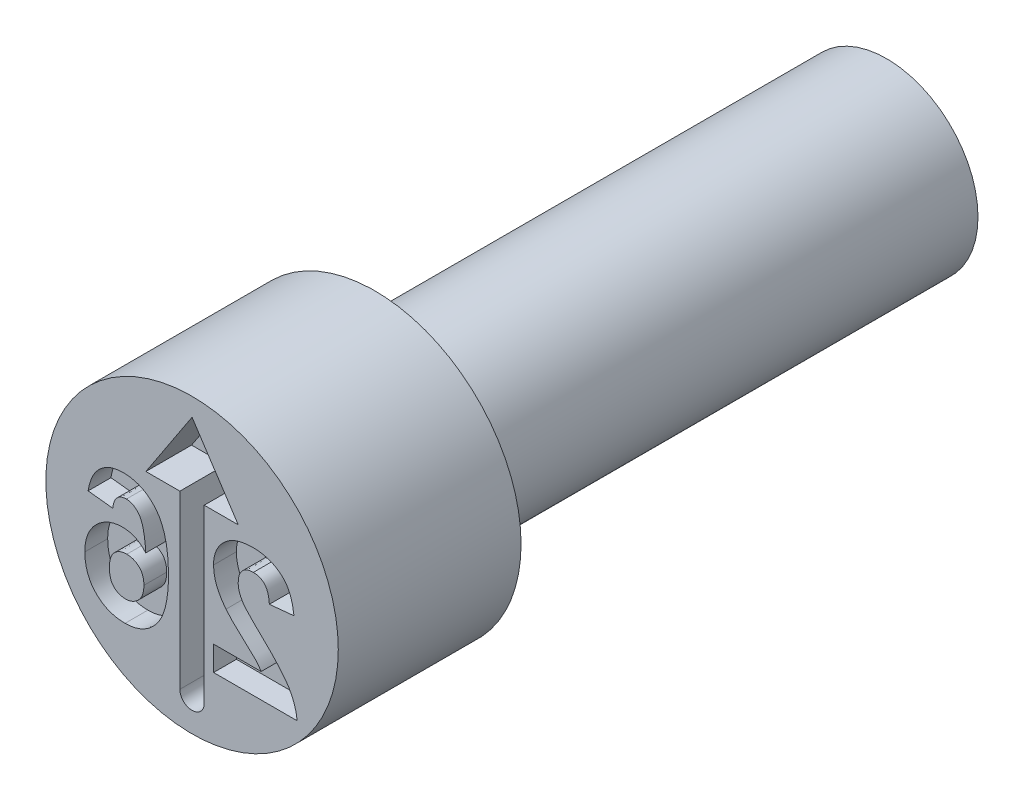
ISO-10303-21;
HEADER;
FILE_DESCRIPTION(('STEP AP214'),'2;1');
FILE_NAME('part.step','',(''),(''),'','','');
FILE_SCHEMA(('AUTOMOTIVE_DESIGN { 1 0 10303 214 1 1 1 1 }'));
ENDSEC;
DATA;
#1=APPLICATION_CONTEXT('core data for automotive mechanical design processes');
#2=APPLICATION_PROTOCOL_DEFINITION('international standard','automotive_design',2000,#1);
#3=PRODUCT_CONTEXT('',#1,'mechanical');
#4=PRODUCT('Part','Part','',(#3));
#5=PRODUCT_RELATED_PRODUCT_CATEGORY('part','',(#4));
#6=PRODUCT_DEFINITION_FORMATION('','',#4);
#7=PRODUCT_DEFINITION_CONTEXT('part definition',#1,'design');
#8=PRODUCT_DEFINITION('design','',#6,#7);
#9=PRODUCT_DEFINITION_SHAPE('','',#8);
#10=(LENGTH_UNIT() NAMED_UNIT(*) SI_UNIT(.MILLI.,.METRE.));
#11=(NAMED_UNIT(*) PLANE_ANGLE_UNIT() SI_UNIT($,.RADIAN.));
#12=(NAMED_UNIT(*) SI_UNIT($,.STERADIAN.) SOLID_ANGLE_UNIT());
#13=UNCERTAINTY_MEASURE_WITH_UNIT(LENGTH_MEASURE(1.E-05),#10,'distance_accuracy_value','');
#14=(GEOMETRIC_REPRESENTATION_CONTEXT(3) GLOBAL_UNCERTAINTY_ASSIGNED_CONTEXT((#13)) GLOBAL_UNIT_ASSIGNED_CONTEXT((#10,
#11,#12)) REPRESENTATION_CONTEXT('',''));
#15=CARTESIAN_POINT('',(0.,0.,0.));
#16=DIRECTION('',(0.,0.,1.));
#17=DIRECTION('',(1.,0.,0.));
#18=AXIS2_PLACEMENT_3D('',#15,#16,#17);
#19=CARTESIAN_POINT('',(0.,0.8,0.));
#20=DIRECTION('',(0.,0.,-1.));
#21=DIRECTION('',(-1.,0.,0.));
#22=AXIS2_PLACEMENT_3D('',#19,#20,#21);
#23=PLANE('',#22);
#24=DIRECTION('',(0.994071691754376,-0.108726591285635,0.));
#25=VECTOR('',#24,1.);
#26=CARTESIAN_POINT('',(-0.568688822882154,0.0672876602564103,0.));
#27=LINE('',#26,#25);
#28=CARTESIAN_POINT('',(-0.568688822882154,0.0672876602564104,0.));
#29=VERTEX_POINT('',#28);
#30=CARTESIAN_POINT('',(-0.434073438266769,0.0525641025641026,0.));
#31=VERTEX_POINT('',#30);
#32=EDGE_CURVE('E334',#29,#31,#27,.T.);
#33=ORIENTED_EDGE('',*,*,#32,.F.);
#34=CARTESIAN_POINT('',(-0.376581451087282,0.25,0.));
#35=CARTESIAN_POINT('',(-0.382899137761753,0.249886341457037,0.));
#36=CARTESIAN_POINT('',(-0.395249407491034,0.249664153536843,0.));
#37=CARTESIAN_POINT('',(-0.413350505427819,0.247304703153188,0.));
#38=CARTESIAN_POINT('',(-0.430618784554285,0.243696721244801,0.));
#39=CARTESIAN_POINT('',(-0.447099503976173,0.238702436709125,0.));
#40=CARTESIAN_POINT('',(-0.462676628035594,0.232014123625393,0.));
#41=CARTESIAN_POINT('',(-0.477412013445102,0.223866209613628,0.));
#42=CARTESIAN_POINT('',(-0.491355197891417,0.214280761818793,0.));
#43=CARTESIAN_POINT('',(-0.504433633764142,0.20331949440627,0.));
#44=CARTESIAN_POINT('',(-0.516542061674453,0.190949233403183,0.));
#45=CARTESIAN_POINT('',(-0.527475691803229,0.177141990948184,0.));
#46=CARTESIAN_POINT('',(-0.537306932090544,0.162064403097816,0.));
#47=CARTESIAN_POINT('',(-0.546078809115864,0.145728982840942,0.));
#48=CARTESIAN_POINT('',(-0.553436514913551,0.127979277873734,0.));
#49=CARTESIAN_POINT('',(-0.559761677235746,0.108954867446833,0.));
#50=CARTESIAN_POINT('',(-0.564963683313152,0.0886148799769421,0.));
#51=CARTESIAN_POINT('',(-0.567428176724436,0.0745051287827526,0.));
#52=CARTESIAN_POINT('',(-0.568688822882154,0.0672876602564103,0.));
#53=B_SPLINE_CURVE_WITH_KNOTS('',3,(#34,#35,#36,#37,#38,#39,#40,#41,#42,#43,#44,#45,#46,#47,#48,
#49,#50,#51,#52),.UNSPECIFIED.,.F.,.F.,(4,1,1,1,1,1,1,1,1,1,1,1,1,1,1,1,4),(0.,
0.0647517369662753,0.126581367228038,0.186839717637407,0.245514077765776,0.302849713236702,
0.360345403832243,0.417912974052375,0.476091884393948,0.535068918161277,0.595103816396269,
0.656390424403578,0.719434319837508,0.784953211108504,0.853160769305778,0.924888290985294,1.),.UNSPECIFIED.);
#54=CARTESIAN_POINT('',(-0.376581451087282,0.25,0.));
#55=VERTEX_POINT('',#54);
#56=EDGE_CURVE('E54',#55,#29,#53,.T.);
#57=ORIENTED_EDGE('',*,*,#56,.F.);
#58=CARTESIAN_POINT('',(-0.128945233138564,-0.109395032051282,0.));
#59=CARTESIAN_POINT('',(-0.129154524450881,-0.0940575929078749,0.));
#60=CARTESIAN_POINT('',(-0.129558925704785,-0.0644219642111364,0.));
#61=CARTESIAN_POINT('',(-0.13281310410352,-0.0216321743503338,0.));
#62=CARTESIAN_POINT('',(-0.137982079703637,0.0178823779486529,0.));
#63=CARTESIAN_POINT('',(-0.145511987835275,0.0540325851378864,0.));
#64=CARTESIAN_POINT('',(-0.155143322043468,0.0868934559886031,0.));
#65=CARTESIAN_POINT('',(-0.166819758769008,0.116531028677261,0.));
#66=CARTESIAN_POINT('',(-0.180834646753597,0.142838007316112,0.));
#67=CARTESIAN_POINT('',(-0.197129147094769,0.165728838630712,0.));
#68=CARTESIAN_POINT('',(-0.215057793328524,0.185626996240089,0.));
#69=CARTESIAN_POINT('',(-0.23432220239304,0.20280248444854,0.));
#70=CARTESIAN_POINT('',(-0.254848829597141,0.217421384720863,0.));
#71=CARTESIAN_POINT('',(-0.276637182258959,0.229446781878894,0.));
#72=CARTESIAN_POINT('',(-0.299866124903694,0.238563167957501,0.));
#73=CARTESIAN_POINT('',(-0.32431532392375,0.245146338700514,0.));
#74=CARTESIAN_POINT('',(-0.350025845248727,0.249377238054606,0.));
#75=CARTESIAN_POINT('',(-0.36763714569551,0.249790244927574,0.));
#76=CARTESIAN_POINT('',(-0.376581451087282,0.25,0.));
#77=B_SPLINE_CURVE_WITH_KNOTS('',3,(#58,#59,#60,#61,#62,#63,#64,#65,#66,#67,#68,#69,#70,#71,#72,
#73,#74,#75,#76),.UNSPECIFIED.,.F.,.F.,(4,1,1,1,1,1,1,1,1,1,1,1,1,1,1,1,4),(0.,
0.0932311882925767,0.180145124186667,0.260720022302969,0.335343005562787,0.40439372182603,
0.46866345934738,0.528671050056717,0.585123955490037,0.639046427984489,0.691174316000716,
0.741714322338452,0.79194664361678,0.84207517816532,0.893016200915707,0.945665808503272,1.),.UNSPECIFIED.);
#78=CARTESIAN_POINT('',(-0.128945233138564,-0.109395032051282,0.));
#79=VERTEX_POINT('',#78);
#80=EDGE_CURVE('E385',#79,#55,#77,.T.);
#81=ORIENTED_EDGE('',*,*,#80,.F.);
#82=CARTESIAN_POINT('',(-0.366485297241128,-0.458974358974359,0.));
#83=CARTESIAN_POINT('',(-0.358011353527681,-0.458737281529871,0.));
#84=CARTESIAN_POINT('',(-0.341350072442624,-0.458271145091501,0.));
#85=CARTESIAN_POINT('',(-0.316959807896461,-0.454435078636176,0.));
#86=CARTESIAN_POINT('',(-0.293771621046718,-0.447945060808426,0.));
#87=CARTESIAN_POINT('',(-0.27178839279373,-0.438881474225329,0.));
#88=CARTESIAN_POINT('',(-0.250827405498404,-0.427480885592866,0.));
#89=CARTESIAN_POINT('',(-0.231083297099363,-0.413319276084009,0.));
#90=CARTESIAN_POINT('',(-0.212608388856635,-0.396531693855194,0.));
#91=CARTESIAN_POINT('',(-0.195158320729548,-0.37734548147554,0.));
#92=CARTESIAN_POINT('',(-0.179279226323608,-0.355183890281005,0.));
#93=CARTESIAN_POINT('',(-0.165756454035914,-0.329569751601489,0.));
#94=CARTESIAN_POINT('',(-0.15428778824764,-0.300783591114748,0.));
#95=CARTESIAN_POINT('',(-0.144950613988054,-0.268751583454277,0.));
#96=CARTESIAN_POINT('',(-0.137742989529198,-0.233476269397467,0.));
#97=CARTESIAN_POINT('',(-0.13271367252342,-0.194954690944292,0.));
#98=CARTESIAN_POINT('',(-0.129373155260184,-0.153250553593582,0.));
#99=CARTESIAN_POINT('',(-0.129091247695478,-0.124359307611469,0.));
#100=CARTESIAN_POINT('',(-0.128945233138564,-0.109395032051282,0.));
#101=B_SPLINE_CURVE_WITH_KNOTS('',3,(#82,#83,#84,#85,#86,#87,#88,#89,#90,#91,#92,#93,#94,#95,
#96,#97,#98,#99,#100),.UNSPECIFIED.,.F.,.F.,(4,1,1,1,1,1,1,1,1,1,1,1,1,1,1,1,4),(0.,
0.0532594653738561,0.104717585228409,0.154775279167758,0.204330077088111,0.25391362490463,
0.304476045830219,0.356706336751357,0.41059695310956,0.467274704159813,0.52762561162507,
0.59224090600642,0.661798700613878,0.737130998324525,0.818387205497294,0.905933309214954,1.),.UNSPECIFIED.);
#102=CARTESIAN_POINT('',(-0.366485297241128,-0.458974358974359,0.));
#103=VERTEX_POINT('',#102);
#104=EDGE_CURVE('E377',#103,#79,#101,.T.);
#105=ORIENTED_EDGE('',*,*,#104,.F.);
#106=CARTESIAN_POINT('',(-0.586637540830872,-0.230689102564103,0.));
#107=CARTESIAN_POINT('',(-0.586443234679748,-0.23910965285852,0.));
#108=CARTESIAN_POINT('',(-0.586064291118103,-0.255531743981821,0.));
#109=CARTESIAN_POINT('',(-0.583275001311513,-0.27958228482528,0.));
#110=CARTESIAN_POINT('',(-0.578347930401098,-0.302283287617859,0.));
#111=CARTESIAN_POINT('',(-0.571616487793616,-0.323816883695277,0.));
#112=CARTESIAN_POINT('',(-0.56290956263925,-0.344012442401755,0.));
#113=CARTESIAN_POINT('',(-0.552361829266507,-0.363036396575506,0.));
#114=CARTESIAN_POINT('',(-0.539616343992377,-0.380563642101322,0.));
#115=CARTESIAN_POINT('',(-0.525251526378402,-0.396829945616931,0.));
#116=CARTESIAN_POINT('',(-0.509237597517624,-0.411345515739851,0.));
#117=CARTESIAN_POINT('',(-0.492171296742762,-0.424199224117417,0.));
#118=CARTESIAN_POINT('',(-0.473863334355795,-0.434884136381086,0.));
#119=CARTESIAN_POINT('',(-0.454584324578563,-0.443877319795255,0.));
#120=CARTESIAN_POINT('',(-0.434003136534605,-0.450477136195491,0.));
#121=CARTESIAN_POINT('',(-0.412482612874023,-0.455426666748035,0.));
#122=CARTESIAN_POINT('',(-0.389847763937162,-0.458445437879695,0.));
#123=CARTESIAN_POINT('',(-0.374393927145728,-0.458795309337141,0.));
#124=CARTESIAN_POINT('',(-0.366485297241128,-0.458974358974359,0.));
#125=B_SPLINE_CURVE_WITH_KNOTS('',3,(#106,#107,#108,#109,#110,#111,#112,#113,#114,#115,#116,
#117,#118,#119,#120,#121,#122,#123,#124),.UNSPECIFIED.,.F.,.F.,(4,1,1,1,1,1,1,1,1,1,1,1,1,1,1,1,
4),(0.,0.0708046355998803,0.138086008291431,0.203231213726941,0.265884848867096,
0.327509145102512,0.387868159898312,0.448411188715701,0.509386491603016,0.570040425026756,
0.629864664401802,0.688715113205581,0.747985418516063,0.808394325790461,0.870086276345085,
0.933515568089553,1.),.UNSPECIFIED.);
#126=CARTESIAN_POINT('',(-0.586637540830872,-0.230689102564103,0.));
#127=VERTEX_POINT('',#126);
#128=EDGE_CURVE('E369',#127,#103,#125,.T.);
#129=ORIENTED_EDGE('',*,*,#128,.F.);
#130=CARTESIAN_POINT('',(-0.379806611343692,-0.0102564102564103,0.));
#131=CARTESIAN_POINT('',(-0.386779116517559,-0.0104572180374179,0.));
#132=CARTESIAN_POINT('',(-0.400547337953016,-0.0108537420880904,0.));
#133=CARTESIAN_POINT('',(-0.420831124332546,-0.0136348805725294,0.));
#134=CARTESIAN_POINT('',(-0.440294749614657,-0.0186358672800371,0.));
#135=CARTESIAN_POINT('',(-0.459026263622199,-0.025400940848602,0.));
#136=CARTESIAN_POINT('',(-0.47711824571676,-0.0339198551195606,0.));
#137=CARTESIAN_POINT('',(-0.49422461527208,-0.0447035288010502,0.));
#138=CARTESIAN_POINT('',(-0.510613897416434,-0.0572768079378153,0.));
#139=CARTESIAN_POINT('',(-0.526060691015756,-0.0716416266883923,0.));
#140=CARTESIAN_POINT('',(-0.540252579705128,-0.0874560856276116,0.));
#141=CARTESIAN_POINT('',(-0.552782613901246,-0.104536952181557,0.));
#142=CARTESIAN_POINT('',(-0.563094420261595,-0.122936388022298,0.));
#143=CARTESIAN_POINT('',(-0.571909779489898,-0.14224245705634,0.));
#144=CARTESIAN_POINT('',(-0.578468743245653,-0.162836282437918,0.));
#145=CARTESIAN_POINT('',(-0.583229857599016,-0.184421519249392,0.));
#146=CARTESIAN_POINT('',(-0.586071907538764,-0.207196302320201,0.));
#147=CARTESIAN_POINT('',(-0.586446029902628,-0.222734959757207,0.));
#148=CARTESIAN_POINT('',(-0.586637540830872,-0.230689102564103,0.));
#149=B_SPLINE_CURVE_WITH_KNOTS('',3,(#130,#131,#132,#133,#134,#135,#136,#137,#138,#139,#140,
#141,#142,#143,#144,#145,#146,#147,#148),.UNSPECIFIED.,.F.,.F.,(4,1,1,1,1,1,1,1,1,1,1,1,1,1,1,1,
4),(0.,0.0619593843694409,0.122347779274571,0.181484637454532,0.240217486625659,
0.299114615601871,0.358819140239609,0.419550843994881,0.482449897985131,0.545990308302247,
0.608137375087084,0.670271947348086,0.733113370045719,0.796428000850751,0.8619364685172,
0.9293261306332,1.),.UNSPECIFIED.);
#150=CARTESIAN_POINT('',(-0.379806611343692,-0.0102564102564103,0.));
#151=VERTEX_POINT('',#150);
#152=EDGE_CURVE('E361',#151,#127,#149,.T.);
#153=ORIENTED_EDGE('',*,*,#152,.F.);
#154=CARTESIAN_POINT('',(-0.253324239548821,-0.0688701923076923,0.));
#155=CARTESIAN_POINT('',(-0.257626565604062,-0.0641972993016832,0.));
#156=CARTESIAN_POINT('',(-0.266062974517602,-0.0550342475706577,0.));
#157=CARTESIAN_POINT('',(-0.28006163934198,-0.0430877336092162,0.));
#158=CARTESIAN_POINT('',(-0.294727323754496,-0.0328742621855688,0.));
#159=CARTESIAN_POINT('',(-0.310219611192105,-0.0244950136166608,0.));
#160=CARTESIAN_POINT('',(-0.326623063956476,-0.0182594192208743,0.));
#161=CARTESIAN_POINT('',(-0.343640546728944,-0.0135248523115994,0.));
#162=CARTESIAN_POINT('',(-0.361494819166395,-0.0108727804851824,0.));
#163=CARTESIAN_POINT('',(-0.373628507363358,-0.0104643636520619,0.));
#164=CARTESIAN_POINT('',(-0.379806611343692,-0.0102564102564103,0.));
#165=B_SPLINE_CURVE_WITH_KNOTS('',3,(#154,#155,#156,#157,#158,#159,#160,#161,#162,#163,#164),
.UNSPECIFIED.,.F.,.F.,(4,1,1,1,1,1,1,1,4),(0.,0.132218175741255,0.259265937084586,
0.382426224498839,0.503963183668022,0.625109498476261,0.747226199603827,0.871295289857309,1.),.UNSPECIFIED.);
#166=CARTESIAN_POINT('',(-0.253324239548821,-0.0688701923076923,0.));
#167=VERTEX_POINT('',#166);
#168=EDGE_CURVE('E353',#167,#151,#165,.T.);
#169=ORIENTED_EDGE('',*,*,#168,.F.);
#170=CARTESIAN_POINT('',(-0.359333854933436,0.133333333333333,0.));
#171=CARTESIAN_POINT('',(-0.35595773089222,0.133250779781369,0.));
#172=CARTESIAN_POINT('',(-0.349239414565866,0.133086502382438,0.));
#173=CARTESIAN_POINT('',(-0.339453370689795,0.131000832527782,0.));
#174=CARTESIAN_POINT('',(-0.330018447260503,0.127905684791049,0.));
#175=CARTESIAN_POINT('',(-0.321011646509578,0.123522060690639,0.));
#176=CARTESIAN_POINT('',(-0.312388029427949,0.117865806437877,0.));
#177=CARTESIAN_POINT('',(-0.304278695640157,0.110869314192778,0.));
#178=CARTESIAN_POINT('',(-0.296310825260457,0.102901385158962,0.));
#179=CARTESIAN_POINT('',(-0.288953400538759,0.0932797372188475,0.));
#180=CARTESIAN_POINT('',(-0.281894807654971,0.081887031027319,0.));
#181=CARTESIAN_POINT('',(-0.27581707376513,0.0679402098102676,0.));
#182=CARTESIAN_POINT('',(-0.270399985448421,0.0514522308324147,0.));
#183=CARTESIAN_POINT('',(-0.265761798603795,0.0323423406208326,0.));
#184=CARTESIAN_POINT('',(-0.261552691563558,0.0107318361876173,0.));
#185=CARTESIAN_POINT('',(-0.258102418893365,-0.0134667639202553,0.));
#186=CARTESIAN_POINT('',(-0.255341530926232,-0.0402752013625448,0.));
#187=CARTESIAN_POINT('',(-0.254017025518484,-0.0590499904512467,0.));
#188=CARTESIAN_POINT('',(-0.253324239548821,-0.0688701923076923,0.));
#189=B_SPLINE_CURVE_WITH_KNOTS('',3,(#170,#171,#172,#173,#174,#175,#176,#177,#178,#179,#180,
#181,#182,#183,#184,#185,#186,#187,#188),.UNSPECIFIED.,.F.,.F.,(4,1,1,1,1,1,1,1,1,1,1,1,1,1,1,1,
4),(0.,0.0401536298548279,0.0799036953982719,0.118642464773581,0.158240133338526,
0.198858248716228,0.241137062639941,0.285631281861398,0.332856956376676,0.385095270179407,
0.444912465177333,0.513585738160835,0.591645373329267,0.679009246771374,0.775790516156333,
0.882726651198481,1.),.UNSPECIFIED.);
#190=CARTESIAN_POINT('',(-0.359333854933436,0.133333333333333,0.));
#191=VERTEX_POINT('',#190);
#192=EDGE_CURVE('E345',#191,#167,#189,.T.);
#193=ORIENTED_EDGE('',*,*,#192,.F.);
#194=CARTESIAN_POINT('',(-0.434073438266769,0.0525641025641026,0.));
#195=CARTESIAN_POINT('',(-0.433171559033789,0.0590477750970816,0.));
#196=CARTESIAN_POINT('',(-0.431474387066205,0.0712488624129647,0.));
#197=CARTESIAN_POINT('',(-0.426447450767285,0.0880863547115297,0.));
#198=CARTESIAN_POINT('',(-0.41944938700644,0.10225098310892,0.));
#199=CARTESIAN_POINT('',(-0.410466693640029,0.113762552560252,0.));
#200=CARTESIAN_POINT('',(-0.399767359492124,0.122622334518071,0.));
#201=CARTESIAN_POINT('',(-0.387576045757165,0.128917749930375,0.));
#202=CARTESIAN_POINT('',(-0.373900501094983,0.13265486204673,0.));
#203=CARTESIAN_POINT('',(-0.364312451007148,0.13310144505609,0.));
#204=CARTESIAN_POINT('',(-0.359333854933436,0.133333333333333,0.));
#205=B_SPLINE_CURVE_WITH_KNOTS('',3,(#194,#195,#196,#197,#198,#199,#200,#201,#202,#203,#204),
.UNSPECIFIED.,.F.,.F.,(4,1,1,1,1,1,1,1,4),(0.,0.160089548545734,0.301259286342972,
0.428171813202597,0.544692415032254,0.656041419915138,0.765564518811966,0.878269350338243,1.),.UNSPECIFIED.);
#206=EDGE_CURVE('E340',#31,#191,#205,.T.);
#207=ORIENTED_EDGE('',*,*,#206,.F.);
#208=EDGE_LOOP('',(#33,#57,#81,#105,#129,#153,#169,#193,#207));
#209=FACE_BOUND('',#208,.T.);
#210=CARTESIAN_POINT('',(0.,0.,0.));
#211=DIRECTION('',(0.,0.,1.));
#212=DIRECTION('',(1.,0.,0.));
#213=AXIS2_PLACEMENT_3D('',#210,#211,#212);
#214=CIRCLE('',#213,0.8);
#215=CARTESIAN_POINT('',(0.8,0.,0.));
#216=VERTEX_POINT('',#215);
#217=EDGE_CURVE('E47',#216,#216,#214,.T.);
#218=ORIENTED_EDGE('',*,*,#217,.T.);
#219=EDGE_LOOP('',(#218));
#220=FACE_BOUND('',#219,.T.);
#221=DIRECTION('',(0.,1.,0.));
#222=VECTOR('',#221,1.);
#223=CARTESIAN_POINT('',(0.0666655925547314,0.31722300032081,0.));
#224=LINE('',#223,#222);
#225=CARTESIAN_POINT('',(0.0666655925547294,-0.62165664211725,0.));
#226=VERTEX_POINT('',#225);
#227=CARTESIAN_POINT('',(0.0666655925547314,0.31722300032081,0.));
#228=VERTEX_POINT('',#227);
#229=EDGE_CURVE('E527',#226,#228,#224,.T.);
#230=ORIENTED_EDGE('',*,*,#229,.F.);
#231=CARTESIAN_POINT('',(0.,-0.62165664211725,0.));
#232=DIRECTION('',(0.,0.,1.));
#233=DIRECTION('',(1.,0.,0.));
#234=AXIS2_PLACEMENT_3D('',#231,#232,#233);
#235=CIRCLE('',#234,0.0666655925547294);
#236=CARTESIAN_POINT('',(-0.0666655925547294,-0.62165664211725,0.));
#237=VERTEX_POINT('',#236);
#238=EDGE_CURVE('E619',#237,#226,#235,.T.);
#239=ORIENTED_EDGE('',*,*,#238,.F.);
#240=DIRECTION('',(0.,-1.,0.));
#241=VECTOR('',#240,1.);
#242=CARTESIAN_POINT('',(-0.0666655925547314,0.31722300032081,0.));
#243=LINE('',#242,#241);
#244=CARTESIAN_POINT('',(-0.0666655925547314,0.31722300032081,0.));
#245=VERTEX_POINT('',#244);
#246=EDGE_CURVE('E649',#245,#237,#243,.T.);
#247=ORIENTED_EDGE('',*,*,#246,.F.);
#248=DIRECTION('',(1.,0.,0.));
#249=VECTOR('',#248,1.);
#250=CARTESIAN_POINT('',(-0.252671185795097,0.31722300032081,0.));
#251=LINE('',#250,#249);
#252=CARTESIAN_POINT('',(-0.252671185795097,0.31722300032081,0.));
#253=VERTEX_POINT('',#252);
#254=EDGE_CURVE('E679',#253,#245,#251,.T.);
#255=ORIENTED_EDGE('',*,*,#254,.F.);
#256=DIRECTION('',(-0.550159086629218,-0.835059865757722,0.));
#257=VECTOR('',#256,1.);
#258=CARTESIAN_POINT('',(0.,0.700740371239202,0.));
#259=LINE('',#258,#257);
#260=CARTESIAN_POINT('',(0.,0.700740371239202,0.));
#261=VERTEX_POINT('',#260);
#262=EDGE_CURVE('E676',#261,#253,#259,.T.);
#263=ORIENTED_EDGE('',*,*,#262,.F.);
#264=DIRECTION('',(-0.550159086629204,0.835059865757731,0.));
#265=VECTOR('',#264,1.);
#266=CARTESIAN_POINT('',(0.,0.700740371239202,0.));
#267=LINE('',#266,#265);
#268=CARTESIAN_POINT('',(0.252671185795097,0.31722300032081,0.));
#269=VERTEX_POINT('',#268);
#270=EDGE_CURVE('E673',#269,#261,#267,.T.);
#271=ORIENTED_EDGE('',*,*,#270,.F.);
#272=DIRECTION('',(1.,0.,0.));
#273=VECTOR('',#272,1.);
#274=CARTESIAN_POINT('',(0.252671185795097,0.31722300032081,0.));
#275=LINE('',#274,#273);
#276=EDGE_CURVE('E670',#228,#269,#275,.T.);
#277=ORIENTED_EDGE('',*,*,#276,.F.);
#278=EDGE_LOOP('',(#230,#239,#247,#255,#263,#271,#277));
#279=FACE_BOUND('',#278,.T.);
#280=DIRECTION('',(0.,-1.,0.));
#281=VECTOR('',#280,1.);
#282=CARTESIAN_POINT('',(0.117670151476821,-0.315384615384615,0.));
#283=LINE('',#282,#281);
#284=CARTESIAN_POINT('',(0.117670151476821,-0.315384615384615,0.));
#285=VERTEX_POINT('',#284);
#286=CARTESIAN_POINT('',(0.117670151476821,-0.45,0.));
#287=VERTEX_POINT('',#286);
#288=EDGE_CURVE('E532',#285,#287,#283,.T.);
#289=ORIENTED_EDGE('',*,*,#288,.F.);
#290=DIRECTION('',(-1.,0.,0.));
#291=VECTOR('',#290,1.);
#292=CARTESIAN_POINT('',(0.377786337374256,-0.315384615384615,0.));
#293=LINE('',#292,#291);
#294=CARTESIAN_POINT('',(0.377786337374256,-0.315384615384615,0.));
#295=VERTEX_POINT('',#294);
#296=EDGE_CURVE('E399',#295,#285,#293,.T.);
#297=ORIENTED_EDGE('',*,*,#296,.F.);
#298=CARTESIAN_POINT('',(0.18553874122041,-0.115985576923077,0.));
#299=CARTESIAN_POINT('',(0.187667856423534,-0.118667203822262,0.));
#300=CARTESIAN_POINT('',(0.19222792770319,-0.124410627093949,0.));
#301=CARTESIAN_POINT('',(0.19998580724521,-0.133217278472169,0.));
#302=CARTESIAN_POINT('',(0.208976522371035,-0.142836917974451,0.));
#303=CARTESIAN_POINT('',(0.219073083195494,-0.153449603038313,0.));
#304=CARTESIAN_POINT('',(0.230608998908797,-0.164679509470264,0.));
#305=CARTESIAN_POINT('',(0.243169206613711,-0.17699626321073,0.));
#306=CARTESIAN_POINT('',(0.257306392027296,-0.189769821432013,0.));
#307=CARTESIAN_POINT('',(0.271949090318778,-0.203318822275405,0.));
#308=CARTESIAN_POINT('',(0.286655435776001,-0.216505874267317,0.));
#309=CARTESIAN_POINT('',(0.300172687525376,-0.229030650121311,0.));
#310=CARTESIAN_POINT('',(0.312450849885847,-0.240112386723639,0.));
#311=CARTESIAN_POINT('',(0.32291810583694,-0.250362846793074,0.));
#312=CARTESIAN_POINT('',(0.332190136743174,-0.25908244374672,0.));
#313=CARTESIAN_POINT('',(0.339932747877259,-0.266718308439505,0.));
#314=CARTESIAN_POINT('',(0.346290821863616,-0.27308558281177,0.));
#315=CARTESIAN_POINT('',(0.35505183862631,-0.283010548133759,0.));
#316=CARTESIAN_POINT('',(0.366199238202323,-0.296434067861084,0.));
#317=CARTESIAN_POINT('',(0.374041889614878,-0.309260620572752,0.));
#318=CARTESIAN_POINT('',(0.377786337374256,-0.315384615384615,0.));
#319=B_SPLINE_CURVE_WITH_KNOTS('',3,(#298,#299,#300,#301,#302,#303,#304,#305,#306,#307,#308,
#309,#310,#311,#312,#313,#314,#315,#316,#317,#318),.UNSPECIFIED.,.F.,.F.,(4,1,1,1,1,1,1,1,1,1,1,
1,1,1,1,1,1,1,4),(0.,0.0369753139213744,0.0791925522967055,0.126700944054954,0.179184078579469,
0.237368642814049,0.300558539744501,0.369153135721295,0.443112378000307,0.516018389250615,
0.582473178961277,0.642136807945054,0.694619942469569,0.740679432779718,0.779589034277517,
0.812073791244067,0.837814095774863,0.922564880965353,1.),.UNSPECIFIED.);
#320=CARTESIAN_POINT('',(0.18553874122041,-0.115985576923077,0.));
#321=VERTEX_POINT('',#320);
#322=EDGE_CURVE('E419',#321,#295,#319,.T.);
#323=ORIENTED_EDGE('',*,*,#322,.F.);
#324=CARTESIAN_POINT('',(0.117670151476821,0.0595753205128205,0.));
#325=CARTESIAN_POINT('',(0.117841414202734,0.0519449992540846,0.));
#326=CARTESIAN_POINT('',(0.118181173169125,0.0368076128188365,0.));
#327=CARTESIAN_POINT('',(0.121434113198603,0.014430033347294,0.));
#328=CARTESIAN_POINT('',(0.126403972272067,-0.00743152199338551,0.));
#329=CARTESIAN_POINT('',(0.133749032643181,-0.0288304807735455,0.));
#330=CARTESIAN_POINT('',(0.143059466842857,-0.0502801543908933,0.));
#331=CARTESIAN_POINT('',(0.155060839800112,-0.0718286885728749,0.));
#332=CARTESIAN_POINT('',(0.168995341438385,-0.0941259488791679,0.));
#333=CARTESIAN_POINT('',(0.179905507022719,-0.108542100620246,0.));
#334=CARTESIAN_POINT('',(0.18553874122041,-0.115985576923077,0.));
#335=B_SPLINE_CURVE_WITH_KNOTS('',3,(#324,#325,#326,#327,#328,#329,#330,#331,#332,#333,#334),
.UNSPECIFIED.,.F.,.F.,(4,1,1,1,1,1,1,1,4),(0.,0.119176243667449,0.236427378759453,
0.352663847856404,0.469086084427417,0.589462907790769,0.717601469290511,0.854189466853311,1.),.UNSPECIFIED.);
#336=CARTESIAN_POINT('',(0.117670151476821,0.0595753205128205,0.));
#337=VERTEX_POINT('',#336);
#338=EDGE_CURVE('E599',#337,#321,#335,.T.);
#339=ORIENTED_EDGE('',*,*,#338,.F.);
#340=CARTESIAN_POINT('',(0.332493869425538,0.25,0.));
#341=CARTESIAN_POINT('',(0.324354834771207,0.24984357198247,0.));
#342=CARTESIAN_POINT('',(0.30850304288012,0.249538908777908,0.));
#343=CARTESIAN_POINT('',(0.285362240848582,0.247022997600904,0.));
#344=CARTESIAN_POINT('',(0.263623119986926,0.242636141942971,0.));
#345=CARTESIAN_POINT('',(0.243095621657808,0.236825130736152,0.));
#346=CARTESIAN_POINT('',(0.223990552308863,0.229067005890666,0.));
#347=CARTESIAN_POINT('',(0.206148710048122,0.219687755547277,0.));
#348=CARTESIAN_POINT('',(0.189850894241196,0.208331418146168,0.));
#349=CARTESIAN_POINT('',(0.174854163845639,0.195617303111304,0.));
#350=CARTESIAN_POINT('',(0.161448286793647,0.18163589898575,0.));
#351=CARTESIAN_POINT('',(0.149705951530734,0.166722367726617,0.));
#352=CARTESIAN_POINT('',(0.139868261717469,0.150887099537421,0.));
#353=CARTESIAN_POINT('',(0.131612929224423,0.134323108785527,0.));
#354=CARTESIAN_POINT('',(0.125483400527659,0.116763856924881,0.));
#355=CARTESIAN_POINT('',(0.121017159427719,0.0984521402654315,0.));
#356=CARTESIAN_POINT('',(0.118055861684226,0.0793025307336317,0.));
#357=CARTESIAN_POINT('',(0.117800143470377,0.0662237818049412,0.));
#358=CARTESIAN_POINT('',(0.117670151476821,0.0595753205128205,0.));
#359=B_SPLINE_CURVE_WITH_KNOTS('',3,(#340,#341,#342,#343,#344,#345,#346,#347,#348,#349,#350,
#351,#352,#353,#354,#355,#356,#357,#358),.UNSPECIFIED.,.F.,.F.,(4,1,1,1,1,1,1,1,1,1,1,1,1,1,1,1,
4),(0.,0.0756723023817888,0.147381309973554,0.216084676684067,0.28169803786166,
0.345459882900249,0.407485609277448,0.46873129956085,0.529782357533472,0.590032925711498,
0.648548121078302,0.70595351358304,0.763101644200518,0.820289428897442,0.878479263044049,
0.938226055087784,1.),.UNSPECIFIED.);
#360=CARTESIAN_POINT('',(0.332493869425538,0.25,0.));
#361=VERTEX_POINT('',#360);
#362=EDGE_CURVE('E591',#361,#337,#359,.T.);
#363=ORIENTED_EDGE('',*,*,#362,.F.);
#364=CARTESIAN_POINT('',(0.55741374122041,0.0388221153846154,0.));
#365=CARTESIAN_POINT('',(0.556331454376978,0.047910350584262,0.));
#366=CARTESIAN_POINT('',(0.554233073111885,0.0655309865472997,0.));
#367=CARTESIAN_POINT('',(0.548996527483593,0.0908402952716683,0.));
#368=CARTESIAN_POINT('',(0.542364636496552,0.114189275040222,0.));
#369=CARTESIAN_POINT('',(0.534021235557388,0.135534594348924,0.));
#370=CARTESIAN_POINT('',(0.524311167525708,0.155011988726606,0.));
#371=CARTESIAN_POINT('',(0.512739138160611,0.172329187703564,0.));
#372=CARTESIAN_POINT('',(0.499709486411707,0.187678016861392,0.));
#373=CARTESIAN_POINT('',(0.485210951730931,0.201050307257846,0.));
#374=CARTESIAN_POINT('',(0.469335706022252,0.212488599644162,0.));
#375=CARTESIAN_POINT('',(0.452677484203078,0.222699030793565,0.));
#376=CARTESIAN_POINT('',(0.434910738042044,0.231074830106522,0.));
#377=CARTESIAN_POINT('',(0.416231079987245,0.237977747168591,0.));
#378=CARTESIAN_POINT('',(0.396646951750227,0.243494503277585,0.));
#379=CARTESIAN_POINT('',(0.376067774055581,0.247142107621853,0.));
#380=CARTESIAN_POINT('',(0.354620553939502,0.24970784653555,0.));
#381=CARTESIAN_POINT('',(0.339980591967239,0.24990114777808,0.));
#382=CARTESIAN_POINT('',(0.332493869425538,0.25,0.));
#383=B_SPLINE_CURVE_WITH_KNOTS('',3,(#364,#365,#366,#367,#368,#369,#370,#371,#372,#373,#374,
#375,#376,#377,#378,#379,#380,#381,#382),.UNSPECIFIED.,.F.,.F.,(4,1,1,1,1,1,1,1,1,1,1,1,1,1,1,1,
4),(0.,0.0794357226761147,0.154013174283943,0.224141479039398,0.289934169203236,
0.352732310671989,0.41272577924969,0.470302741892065,0.527168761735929,0.583502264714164,
0.639948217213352,0.696584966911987,0.753726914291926,0.812707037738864,0.872963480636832,
0.93503486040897,1.),.UNSPECIFIED.);
#384=CARTESIAN_POINT('',(0.55741374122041,0.0388221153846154,0.));
#385=VERTEX_POINT('',#384);
#386=EDGE_CURVE('E586',#385,#361,#383,.T.);
#387=ORIENTED_EDGE('',*,*,#386,.F.);
#388=DIRECTION('',(0.995240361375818,0.097450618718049,0.));
#389=VECTOR('',#388,1.);
#390=CARTESIAN_POINT('',(0.422798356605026,0.0256410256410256,0.));
#391=LINE('',#390,#389);
#392=CARTESIAN_POINT('',(0.422798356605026,0.0256410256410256,0.));
#393=VERTEX_POINT('',#392);
#394=EDGE_CURVE('E580',#393,#385,#391,.T.);
#395=ORIENTED_EDGE('',*,*,#394,.F.);
#396=CARTESIAN_POINT('',(0.335298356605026,0.133333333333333,0.));
#397=CARTESIAN_POINT('',(0.341403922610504,0.133056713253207,0.));
#398=CARTESIAN_POINT('',(0.353198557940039,0.132522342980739,0.));
#399=CARTESIAN_POINT('',(0.369961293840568,0.12785415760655,0.));
#400=CARTESIAN_POINT('',(0.384625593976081,0.119773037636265,0.));
#401=CARTESIAN_POINT('',(0.395076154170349,0.110563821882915,0.));
#402=CARTESIAN_POINT('',(0.402136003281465,0.101608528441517,0.));
#403=CARTESIAN_POINT('',(0.406946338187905,0.0938045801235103,0.));
#404=CARTESIAN_POINT('',(0.411092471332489,0.0849369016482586,0.));
#405=CARTESIAN_POINT('',(0.414766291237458,0.0751053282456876,0.));
#406=CARTESIAN_POINT('',(0.417668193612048,0.0641972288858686,0.));
#407=CARTESIAN_POINT('',(0.420005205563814,0.0522956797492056,0.));
#408=CARTESIAN_POINT('',(0.421888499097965,0.039336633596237,0.));
#409=CARTESIAN_POINT('',(0.422487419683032,0.0303213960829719,0.));
#410=CARTESIAN_POINT('',(0.422798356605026,0.0256410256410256,0.));
#411=B_SPLINE_CURVE_WITH_KNOTS('',3,(#396,#397,#398,#399,#400,#401,#402,#403,#404,#405,#406,
#407,#408,#409,#410),.UNSPECIFIED.,.F.,.F.,(4,1,1,1,1,1,1,1,1,1,1,1,4),(0.,0.116899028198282,
0.225823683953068,0.330086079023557,0.435451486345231,0.490306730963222,0.54824405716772,
0.610766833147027,0.677675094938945,0.749188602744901,0.826858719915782,0.910111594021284,1.),.UNSPECIFIED.);
#412=CARTESIAN_POINT('',(0.335298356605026,0.133333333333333,0.));
#413=VERTEX_POINT('',#412);
#414=EDGE_CURVE('E572',#413,#393,#411,.T.);
#415=ORIENTED_EDGE('',*,*,#414,.F.);
#416=CARTESIAN_POINT('',(0.252285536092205,0.0414863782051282,0.));
#417=CARTESIAN_POINT('',(0.252537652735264,0.048470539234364,0.));
#418=CARTESIAN_POINT('',(0.253014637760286,0.0616840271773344,0.));
#419=CARTESIAN_POINT('',(0.257014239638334,0.0803307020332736,0.));
#420=CARTESIAN_POINT('',(0.264106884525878,0.0963601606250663,0.));
#421=CARTESIAN_POINT('',(0.273872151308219,0.109821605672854,0.));
#422=CARTESIAN_POINT('',(0.286220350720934,0.120368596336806,0.));
#423=CARTESIAN_POINT('',(0.300655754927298,0.128161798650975,0.));
#424=CARTESIAN_POINT('',(0.31738967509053,0.132470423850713,0.));
#425=CARTESIAN_POINT('',(0.329151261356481,0.1330371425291,0.));
#426=CARTESIAN_POINT('',(0.335298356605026,0.133333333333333,0.));
#427=B_SPLINE_CURVE_WITH_KNOTS('',3,(#416,#417,#418,#419,#420,#421,#422,#423,#424,#425,#426),
.UNSPECIFIED.,.F.,.F.,(4,1,1,1,1,1,1,1,4),(0.,0.149140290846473,0.282161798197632,
0.40465570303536,0.521109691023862,0.634416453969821,0.748796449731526,0.868710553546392,1.),.UNSPECIFIED.);
#428=CARTESIAN_POINT('',(0.252285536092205,0.0414863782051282,0.));
#429=VERTEX_POINT('',#428);
#430=EDGE_CURVE('E564',#429,#413,#427,.T.);
#431=ORIENTED_EDGE('',*,*,#430,.F.);
#432=CARTESIAN_POINT('',(0.278928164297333,-0.0394230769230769,0.));
#433=CARTESIAN_POINT('',(0.274875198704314,-0.0326906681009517,0.));
#434=CARTESIAN_POINT('',(0.267057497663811,-0.0197046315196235,0.));
#435=CARTESIAN_POINT('',(0.258484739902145,0.000716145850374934,0.));
#436=CARTESIAN_POINT('',(0.253339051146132,0.0211327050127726,0.));
#437=CARTESIAN_POINT('',(0.252632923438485,0.0347749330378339,0.));
#438=CARTESIAN_POINT('',(0.252285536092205,0.0414863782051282,0.));
#439=B_SPLINE_CURVE_WITH_KNOTS('',3,(#432,#433,#434,#435,#436,#437,#438),.UNSPECIFIED.,.F.,.F.,
(4,1,1,1,4),(0.,0.272795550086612,0.526191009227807,0.766904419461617,1.),.UNSPECIFIED.);
#440=CARTESIAN_POINT('',(0.278928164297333,-0.0394230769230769,0.));
#441=VERTEX_POINT('',#440);
#442=EDGE_CURVE('E556',#441,#429,#439,.T.);
#443=ORIENTED_EDGE('',*,*,#442,.F.);
#444=CARTESIAN_POINT('',(0.386059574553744,-0.15244391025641,0.));
#445=CARTESIAN_POINT('',(0.379138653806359,-0.145763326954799,0.));
#446=CARTESIAN_POINT('',(0.365963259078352,-0.133045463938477,0.));
#447=CARTESIAN_POINT('',(0.347201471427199,-0.114833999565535,0.));
#448=CARTESIAN_POINT('',(0.330707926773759,-0.0980924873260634,0.));
#449=CARTESIAN_POINT('',(0.316137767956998,-0.0832547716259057,0.));
#450=CARTESIAN_POINT('',(0.303827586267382,-0.0699430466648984,0.));
#451=CARTESIAN_POINT('',(0.293615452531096,-0.0583663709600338,0.));
#452=CARTESIAN_POINT('',(0.285372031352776,-0.048477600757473,0.));
#453=CARTESIAN_POINT('',(0.280907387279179,-0.0422041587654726,0.));
#454=CARTESIAN_POINT('',(0.278928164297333,-0.0394230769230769,0.));
#455=B_SPLINE_CURVE_WITH_KNOTS('',3,(#444,#445,#446,#447,#448,#449,#450,#451,#452,#453,#454),
.UNSPECIFIED.,.F.,.F.,(4,1,1,1,1,1,1,1,4),(0.,0.18509006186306,0.352356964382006,
0.503079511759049,0.637279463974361,0.752473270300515,0.851885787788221,0.934339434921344,1.),.UNSPECIFIED.);
#456=CARTESIAN_POINT('',(0.386059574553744,-0.15244391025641,0.));
#457=VERTEX_POINT('',#456);
#458=EDGE_CURVE('E548',#457,#441,#455,.T.);
#459=ORIENTED_EDGE('',*,*,#458,.F.);
#460=CARTESIAN_POINT('',(0.575362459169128,-0.45,0.));
#461=CARTESIAN_POINT('',(0.573812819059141,-0.438495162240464,0.));
#462=CARTESIAN_POINT('',(0.570714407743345,-0.415491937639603,0.));
#463=CARTESIAN_POINT('',(0.56113522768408,-0.381890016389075,0.));
#464=CARTESIAN_POINT('',(0.548350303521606,-0.349100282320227,0.));
#465=CARTESIAN_POINT('',(0.534474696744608,-0.322417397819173,0.));
#466=CARTESIAN_POINT('',(0.520673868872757,-0.300938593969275,0.));
#467=CARTESIAN_POINT('',(0.508152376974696,-0.283338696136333,0.));
#468=CARTESIAN_POINT('',(0.493214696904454,-0.264613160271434,0.));
#469=CARTESIAN_POINT('',(0.476077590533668,-0.24461081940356,0.));
#470=CARTESIAN_POINT('',(0.456835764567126,-0.223269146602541,0.));
#471=CARTESIAN_POINT('',(0.43534566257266,-0.200667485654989,0.));
#472=CARTESIAN_POINT('',(0.411504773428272,-0.176914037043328,0.));
#473=CARTESIAN_POINT('',(0.394732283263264,-0.160784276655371,0.));
#474=CARTESIAN_POINT('',(0.386059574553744,-0.15244391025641,0.));
#475=B_SPLINE_CURVE_WITH_KNOTS('',3,(#460,#461,#462,#463,#464,#465,#466,#467,#468,#469,#470,
#471,#472,#473,#474),.UNSPECIFIED.,.F.,.F.,(4,1,1,1,1,1,1,1,1,1,1,1,4),(0.,0.0963574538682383,
0.192660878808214,0.289454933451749,0.388479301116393,0.441921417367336,0.501521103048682,
0.567882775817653,0.640891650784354,0.72037065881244,0.806636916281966,0.900015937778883,1.),.UNSPECIFIED.);
#476=CARTESIAN_POINT('',(0.575362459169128,-0.45,0.));
#477=VERTEX_POINT('',#476);
#478=EDGE_CURVE('E539',#477,#457,#475,.T.);
#479=ORIENTED_EDGE('',*,*,#478,.F.);
#480=DIRECTION('',(1.,0.,0.));
#481=VECTOR('',#480,1.);
#482=CARTESIAN_POINT('',(0.117670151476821,-0.45,0.));
#483=LINE('',#482,#481);
#484=EDGE_CURVE('E536',#287,#477,#483,.T.);
#485=ORIENTED_EDGE('',*,*,#484,.F.);
#486=EDGE_LOOP('',(#289,#297,#323,#339,#363,#387,#395,#415,#431,#443,#459,#479,#485));
#487=FACE_BOUND('',#486,.T.);
#488=ADVANCED_FACE('F39',(#209,#220,#279,#487),#23,.F.);
#489=CARTESIAN_POINT('',(0.,0.499999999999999,-1.));
#490=DIRECTION('',(0.,0.,1.));
#491=DIRECTION('',(1.,0.,0.));
#492=AXIS2_PLACEMENT_3D('',#489,#490,#491);
#493=PLANE('',#492);
#494=CARTESIAN_POINT('',(0.,0.,-1.));
#495=DIRECTION('',(0.,0.,1.));
#496=DIRECTION('',(1.,0.,0.));
#497=AXIS2_PLACEMENT_3D('',#494,#495,#496);
#498=CIRCLE('',#497,0.8);
#499=CARTESIAN_POINT('',(0.8,0.,-1.));
#500=VERTEX_POINT('',#499);
#501=EDGE_CURVE('E11',#500,#500,#498,.T.);
#502=ORIENTED_EDGE('',*,*,#501,.F.);
#503=EDGE_LOOP('',(#502));
#504=FACE_BOUND('',#503,.T.);
#505=CARTESIAN_POINT('',(0.,0.,-1.));
#506=DIRECTION('',(0.,0.,1.));
#507=DIRECTION('',(1.,0.,0.));
#508=AXIS2_PLACEMENT_3D('',#505,#506,#507);
#509=CIRCLE('',#508,0.499999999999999);
#510=CARTESIAN_POINT('',(0.499999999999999,0.,-1.));
#511=VERTEX_POINT('',#510);
#512=EDGE_CURVE('E686',#511,#511,#509,.T.);
#513=ORIENTED_EDGE('',*,*,#512,.T.);
#514=EDGE_LOOP('',(#513));
#515=FACE_BOUND('',#514,.T.);
#516=ADVANCED_FACE('F41',(#504,#515),#493,.F.);
#517=CARTESIAN_POINT('',(0.,0.,-0.403888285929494));
#518=DIRECTION('',(0.,0.,1.));
#519=DIRECTION('',(1.,0.,0.));
#520=AXIS2_PLACEMENT_3D('',#517,#518,#519);
#521=CYLINDRICAL_SURFACE('',#520,0.8);
#522=ORIENTED_EDGE('',*,*,#217,.F.);
#523=EDGE_LOOP('',(#522));
#524=FACE_BOUND('',#523,.T.);
#525=ORIENTED_EDGE('',*,*,#501,.T.);
#526=EDGE_LOOP('',(#525));
#527=FACE_BOUND('',#526,.T.);
#528=ADVANCED_FACE('F499',(#524,#527),#521,.T.);
#529=CARTESIAN_POINT('',(0.,0.,-3.8));
#530=DIRECTION('',(0.,0.,1.));
#531=DIRECTION('',(1.,0.,0.));
#532=AXIS2_PLACEMENT_3D('',#529,#530,#531);
#533=PLANE('',#532);
#534=CARTESIAN_POINT('',(0.,0.,-3.8));
#535=DIRECTION('',(0.,0.,1.));
#536=DIRECTION('',(1.,0.,0.));
#537=AXIS2_PLACEMENT_3D('',#534,#535,#536);
#538=CIRCLE('',#537,0.499999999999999);
#539=CARTESIAN_POINT('',(0.499999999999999,0.,-3.8));
#540=VERTEX_POINT('',#539);
#541=EDGE_CURVE('E701',#540,#540,#538,.T.);
#542=ORIENTED_EDGE('',*,*,#541,.F.);
#543=EDGE_LOOP('',(#542));
#544=FACE_BOUND('',#543,.T.);
#545=ADVANCED_FACE('F495',(#544),#533,.F.);
#546=CARTESIAN_POINT('',(0.,0.,-0.403888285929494));
#547=DIRECTION('',(0.,0.,1.));
#548=DIRECTION('',(1.,0.,0.));
#549=AXIS2_PLACEMENT_3D('',#546,#547,#548);
#550=CYLINDRICAL_SURFACE('',#549,0.499999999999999);
#551=ORIENTED_EDGE('',*,*,#512,.F.);
#552=EDGE_LOOP('',(#551));
#553=FACE_BOUND('',#552,.T.);
#554=ORIENTED_EDGE('',*,*,#541,.T.);
#555=EDGE_LOOP('',(#554));
#556=FACE_BOUND('',#555,.T.);
#557=ADVANCED_FACE('F491',(#553,#556),#550,.T.);
#558=CARTESIAN_POINT('',(0.,-0.62165664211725,-0.25));
#559=DIRECTION('',(0.,0.,1.));
#560=DIRECTION('',(1.,0.,0.));
#561=AXIS2_PLACEMENT_3D('',#558,#559,#560);
#562=CYLINDRICAL_SURFACE('',#561,0.0666655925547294);
#563=ORIENTED_EDGE('',*,*,#238,.T.);
#564=DIRECTION('',(0.,0.,1.));
#565=VECTOR('',#564,1.);
#566=CARTESIAN_POINT('',(0.0666655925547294,-0.62165664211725,-0.25));
#567=LINE('',#566,#565);
#568=CARTESIAN_POINT('',(0.0666655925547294,-0.62165664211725,-0.25));
#569=VERTEX_POINT('',#568);
#570=EDGE_CURVE('E667',#569,#226,#567,.T.);
#571=ORIENTED_EDGE('',*,*,#570,.F.);
#572=CARTESIAN_POINT('',(0.,-0.62165664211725,-0.25));
#573=DIRECTION('',(0.,0.,1.));
#574=DIRECTION('',(1.,0.,0.));
#575=AXIS2_PLACEMENT_3D('',#572,#573,#574);
#576=CIRCLE('',#575,0.0666655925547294);
#577=CARTESIAN_POINT('',(-0.0666655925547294,-0.62165664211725,-0.25));
#578=VERTEX_POINT('',#577);
#579=EDGE_CURVE('E645',#578,#569,#576,.T.);
#580=ORIENTED_EDGE('',*,*,#579,.F.);
#581=DIRECTION('',(0.,0.,1.));
#582=VECTOR('',#581,1.);
#583=CARTESIAN_POINT('',(-0.0666655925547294,-0.62165664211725,-0.25));
#584=LINE('',#583,#582);
#585=EDGE_CURVE('E684',#578,#237,#584,.T.);
#586=ORIENTED_EDGE('',*,*,#585,.T.);
#587=EDGE_LOOP('',(#563,#571,#580,#586));
#588=FACE_BOUND('',#587,.T.);
#589=ADVANCED_FACE('F469',(#588),#562,.F.);
#590=CARTESIAN_POINT('',(-0.0666655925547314,0.31722300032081,-0.25));
#591=DIRECTION('',(-1.,0.,0.));
#592=DIRECTION('',(0.,-1.,0.));
#593=AXIS2_PLACEMENT_3D('',#590,#591,#592);
#594=PLANE('',#593);
#595=ORIENTED_EDGE('',*,*,#246,.T.);
#596=ORIENTED_EDGE('',*,*,#585,.F.);
#597=DIRECTION('',(0.,-1.,0.));
#598=VECTOR('',#597,1.);
#599=CARTESIAN_POINT('',(-0.0666655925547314,0.31722300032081,-0.25));
#600=LINE('',#599,#598);
#601=CARTESIAN_POINT('',(-0.0666655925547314,0.31722300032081,-0.25));
#602=VERTEX_POINT('',#601);
#603=EDGE_CURVE('E664',#602,#578,#600,.T.);
#604=ORIENTED_EDGE('',*,*,#603,.F.);
#605=DIRECTION('',(0.,0.,1.));
#606=VECTOR('',#605,1.);
#607=CARTESIAN_POINT('',(-0.0666655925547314,0.31722300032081,-0.25));
#608=LINE('',#607,#606);
#609=EDGE_CURVE('E687',#602,#245,#608,.T.);
#610=ORIENTED_EDGE('',*,*,#609,.T.);
#611=EDGE_LOOP('',(#595,#596,#604,#610));
#612=FACE_BOUND('',#611,.T.);
#613=ADVANCED_FACE('F465',(#612),#594,.F.);
#614=CARTESIAN_POINT('',(-0.252671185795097,0.31722300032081,-0.25));
#615=DIRECTION('',(0.,-1.,0.));
#616=DIRECTION('',(0.,0.,-1.));
#617=AXIS2_PLACEMENT_3D('',#614,#615,#616);
#618=PLANE('',#617);
#619=ORIENTED_EDGE('',*,*,#254,.T.);
#620=ORIENTED_EDGE('',*,*,#609,.F.);
#621=DIRECTION('',(1.,0.,0.));
#622=VECTOR('',#621,1.);
#623=CARTESIAN_POINT('',(-0.252671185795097,0.31722300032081,-0.25));
#624=LINE('',#623,#622);
#625=CARTESIAN_POINT('',(-0.252671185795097,0.31722300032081,-0.25));
#626=VERTEX_POINT('',#625);
#627=EDGE_CURVE('E661',#626,#602,#624,.T.);
#628=ORIENTED_EDGE('',*,*,#627,.F.);
#629=DIRECTION('',(0.,0.,1.));
#630=VECTOR('',#629,1.);
#631=CARTESIAN_POINT('',(-0.252671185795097,0.31722300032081,-0.25));
#632=LINE('',#631,#630);
#633=EDGE_CURVE('E689',#626,#253,#632,.T.);
#634=ORIENTED_EDGE('',*,*,#633,.T.);
#635=EDGE_LOOP('',(#619,#620,#628,#634));
#636=FACE_BOUND('',#635,.T.);
#637=ADVANCED_FACE('F468',(#636),#618,.F.);
#638=CARTESIAN_POINT('',(0.,0.700740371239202,-0.25));
#639=DIRECTION('',(-0.835059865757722,0.550159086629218,0.));
#640=DIRECTION('',(-0.550159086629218,-0.835059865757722,0.));
#641=AXIS2_PLACEMENT_3D('',#638,#639,#640);
#642=PLANE('',#641);
#643=ORIENTED_EDGE('',*,*,#262,.T.);
#644=ORIENTED_EDGE('',*,*,#633,.F.);
#645=DIRECTION('',(-0.550159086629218,-0.835059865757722,0.));
#646=VECTOR('',#645,1.);
#647=CARTESIAN_POINT('',(0.,0.700740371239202,-0.25));
#648=LINE('',#647,#646);
#649=CARTESIAN_POINT('',(0.,0.700740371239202,-0.25));
#650=VERTEX_POINT('',#649);
#651=EDGE_CURVE('E658',#650,#626,#648,.T.);
#652=ORIENTED_EDGE('',*,*,#651,.F.);
#653=DIRECTION('',(0.,0.,1.));
#654=VECTOR('',#653,1.);
#655=CARTESIAN_POINT('',(0.,0.700740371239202,-0.25));
#656=LINE('',#655,#654);
#657=EDGE_CURVE('E691',#650,#261,#656,.T.);
#658=ORIENTED_EDGE('',*,*,#657,.T.);
#659=EDGE_LOOP('',(#643,#644,#652,#658));
#660=FACE_BOUND('',#659,.T.);
#661=ADVANCED_FACE('F473',(#660),#642,.F.);
#662=CARTESIAN_POINT('',(0.,0.700740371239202,-0.25));
#663=DIRECTION('',(0.835059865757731,0.550159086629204,0.));
#664=DIRECTION('',(-0.550159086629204,0.835059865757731,0.));
#665=AXIS2_PLACEMENT_3D('',#662,#663,#664);
#666=PLANE('',#665);
#667=ORIENTED_EDGE('',*,*,#270,.T.);
#668=ORIENTED_EDGE('',*,*,#657,.F.);
#669=DIRECTION('',(-0.550159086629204,0.835059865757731,0.));
#670=VECTOR('',#669,1.);
#671=CARTESIAN_POINT('',(0.,0.700740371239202,-0.25));
#672=LINE('',#671,#670);
#673=CARTESIAN_POINT('',(0.252671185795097,0.31722300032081,-0.25));
#674=VERTEX_POINT('',#673);
#675=EDGE_CURVE('E655',#674,#650,#672,.T.);
#676=ORIENTED_EDGE('',*,*,#675,.F.);
#677=DIRECTION('',(0.,0.,1.));
#678=VECTOR('',#677,1.);
#679=CARTESIAN_POINT('',(0.252671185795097,0.31722300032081,-0.25));
#680=LINE('',#679,#678);
#681=EDGE_CURVE('E693',#674,#269,#680,.T.);
#682=ORIENTED_EDGE('',*,*,#681,.T.);
#683=EDGE_LOOP('',(#667,#668,#676,#682));
#684=FACE_BOUND('',#683,.T.);
#685=ADVANCED_FACE('F477',(#684),#666,.F.);
#686=CARTESIAN_POINT('',(0.252671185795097,0.31722300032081,-0.25));
#687=DIRECTION('',(0.,-1.,0.));
#688=DIRECTION('',(0.,0.,-1.));
#689=AXIS2_PLACEMENT_3D('',#686,#687,#688);
#690=PLANE('',#689);
#691=ORIENTED_EDGE('',*,*,#276,.T.);
#692=ORIENTED_EDGE('',*,*,#681,.F.);
#693=DIRECTION('',(1.,0.,0.));
#694=VECTOR('',#693,1.);
#695=CARTESIAN_POINT('',(0.252671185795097,0.31722300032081,-0.25));
#696=LINE('',#695,#694);
#697=CARTESIAN_POINT('',(0.0666655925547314,0.31722300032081,-0.25));
#698=VERTEX_POINT('',#697);
#699=EDGE_CURVE('E652',#698,#674,#696,.T.);
#700=ORIENTED_EDGE('',*,*,#699,.F.);
#701=DIRECTION('',(0.,0.,1.));
#702=VECTOR('',#701,1.);
#703=CARTESIAN_POINT('',(0.0666655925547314,0.31722300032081,-0.25));
#704=LINE('',#703,#702);
#705=EDGE_CURVE('E695',#698,#228,#704,.T.);
#706=ORIENTED_EDGE('',*,*,#705,.T.);
#707=EDGE_LOOP('',(#691,#692,#700,#706));
#708=FACE_BOUND('',#707,.T.);
#709=ADVANCED_FACE('F481',(#708),#690,.F.);
#710=CARTESIAN_POINT('',(0.0666655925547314,0.31722300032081,-0.25));
#711=DIRECTION('',(1.,0.,0.));
#712=DIRECTION('',(0.,1.,0.));
#713=AXIS2_PLACEMENT_3D('',#710,#711,#712);
#714=PLANE('',#713);
#715=ORIENTED_EDGE('',*,*,#229,.T.);
#716=ORIENTED_EDGE('',*,*,#705,.F.);
#717=DIRECTION('',(0.,1.,0.));
#718=VECTOR('',#717,1.);
#719=CARTESIAN_POINT('',(0.0666655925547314,0.31722300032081,-0.25));
#720=LINE('',#719,#718);
#721=EDGE_CURVE('E648',#569,#698,#720,.T.);
#722=ORIENTED_EDGE('',*,*,#721,.F.);
#723=ORIENTED_EDGE('',*,*,#570,.T.);
#724=EDGE_LOOP('',(#715,#716,#722,#723));
#725=FACE_BOUND('',#724,.T.);
#726=ADVANCED_FACE('F463',(#725),#714,.F.);
#727=CARTESIAN_POINT('',(0.,-0.62165664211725,-0.25));
#728=DIRECTION('',(0.,0.,1.));
#729=DIRECTION('',(1.,0.,0.));
#730=AXIS2_PLACEMENT_3D('',#727,#728,#729);
#731=PLANE('',#730);
#732=ORIENTED_EDGE('',*,*,#579,.T.);
#733=ORIENTED_EDGE('',*,*,#721,.T.);
#734=ORIENTED_EDGE('',*,*,#699,.T.);
#735=ORIENTED_EDGE('',*,*,#675,.T.);
#736=ORIENTED_EDGE('',*,*,#651,.T.);
#737=ORIENTED_EDGE('',*,*,#627,.T.);
#738=ORIENTED_EDGE('',*,*,#603,.T.);
#739=EDGE_LOOP('',(#732,#733,#734,#735,#736,#737,#738));
#740=FACE_BOUND('',#739,.T.);
#741=ADVANCED_FACE('F459',(#740),#731,.T.);
#742=CARTESIAN_POINT('',(0.377786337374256,-0.315384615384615,-0.125));
#743=DIRECTION('',(0.,1.,0.));
#744=DIRECTION('',(0.,0.,1.));
#745=AXIS2_PLACEMENT_3D('',#742,#743,#744);
#746=PLANE('',#745);
#747=ORIENTED_EDGE('',*,*,#296,.T.);
#748=DIRECTION('',(0.,0.,1.));
#749=VECTOR('',#748,1.);
#750=CARTESIAN_POINT('',(0.117670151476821,-0.315384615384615,-0.125));
#751=LINE('',#750,#749);
#752=CARTESIAN_POINT('',(0.117670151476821,-0.315384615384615,-0.125));
#753=VERTEX_POINT('',#752);
#754=EDGE_CURVE('E642',#753,#285,#751,.T.);
#755=ORIENTED_EDGE('',*,*,#754,.F.);
#756=DIRECTION('',(-1.,0.,0.));
#757=VECTOR('',#756,1.);
#758=CARTESIAN_POINT('',(0.377786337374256,-0.315384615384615,-0.125));
#759=LINE('',#758,#757);
#760=CARTESIAN_POINT('',(0.377786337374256,-0.315384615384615,-0.125));
#761=VERTEX_POINT('',#760);
#762=EDGE_CURVE('E415',#761,#753,#759,.T.);
#763=ORIENTED_EDGE('',*,*,#762,.F.);
#764=DIRECTION('',(0.,0.,1.));
#765=VECTOR('',#764,1.);
#766=CARTESIAN_POINT('',(0.377786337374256,-0.315384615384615,-0.125));
#767=LINE('',#766,#765);
#768=EDGE_CURVE('E614',#761,#295,#767,.T.);
#769=ORIENTED_EDGE('',*,*,#768,.T.);
#770=EDGE_LOOP('',(#747,#755,#763,#769));
#771=FACE_BOUND('',#770,.T.);
#772=ADVANCED_FACE('F455',(#771),#746,.F.);
#773=CARTESIAN_POINT('',(0.18553874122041,-0.115985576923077,-0.125));
#774=CARTESIAN_POINT('',(0.187667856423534,-0.118667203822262,-0.125));
#775=CARTESIAN_POINT('',(0.19222792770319,-0.124410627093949,-0.125));
#776=CARTESIAN_POINT('',(0.19998580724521,-0.133217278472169,-0.125));
#777=CARTESIAN_POINT('',(0.208976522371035,-0.142836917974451,-0.125));
#778=CARTESIAN_POINT('',(0.219073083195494,-0.153449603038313,-0.125));
#779=CARTESIAN_POINT('',(0.230608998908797,-0.164679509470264,-0.125));
#780=CARTESIAN_POINT('',(0.243169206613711,-0.17699626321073,-0.125));
#781=CARTESIAN_POINT('',(0.257306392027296,-0.189769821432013,-0.125));
#782=CARTESIAN_POINT('',(0.271949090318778,-0.203318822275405,-0.125));
#783=CARTESIAN_POINT('',(0.286655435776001,-0.216505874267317,-0.125));
#784=CARTESIAN_POINT('',(0.300172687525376,-0.229030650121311,-0.125));
#785=CARTESIAN_POINT('',(0.312450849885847,-0.240112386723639,-0.125));
#786=CARTESIAN_POINT('',(0.32291810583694,-0.250362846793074,-0.125));
#787=CARTESIAN_POINT('',(0.332190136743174,-0.25908244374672,-0.125));
#788=CARTESIAN_POINT('',(0.339932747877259,-0.266718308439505,-0.125));
#789=CARTESIAN_POINT('',(0.346290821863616,-0.27308558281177,-0.125));
#790=CARTESIAN_POINT('',(0.35505183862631,-0.283010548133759,-0.125));
#791=CARTESIAN_POINT('',(0.366199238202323,-0.296434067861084,-0.125));
#792=CARTESIAN_POINT('',(0.374041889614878,-0.309260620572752,-0.125));
#793=CARTESIAN_POINT('',(0.377786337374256,-0.315384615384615,-0.125));
#794=B_SPLINE_CURVE_WITH_KNOTS('',3,(#773,#774,#775,#776,#777,#778,#779,#780,#781,#782,#783,
#784,#785,#786,#787,#788,#789,#790,#791,#792,#793),.UNSPECIFIED.,.F.,.F.,(4,1,1,1,1,1,1,1,1,1,1,
1,1,1,1,1,1,1,4),(0.,0.0369753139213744,0.0791925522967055,0.126700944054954,0.179184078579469,
0.237368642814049,0.300558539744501,0.369153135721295,0.443112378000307,0.516018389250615,
0.582473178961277,0.642136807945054,0.694619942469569,0.740679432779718,0.779589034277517,
0.812073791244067,0.837814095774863,0.922564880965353,1.),.UNSPECIFIED.);
#795=DIRECTION('',(0.,0.,1.));
#796=VECTOR('',#795,1.);
#797=SURFACE_OF_LINEAR_EXTRUSION('',#794,#796);
#798=ORIENTED_EDGE('',*,*,#322,.T.);
#799=ORIENTED_EDGE('',*,*,#768,.F.);
#800=CARTESIAN_POINT('',(0.18553874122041,-0.115985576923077,-0.125));
#801=VERTEX_POINT('',#800);
#802=EDGE_CURVE('E644',#801,#761,#794,.T.);
#803=ORIENTED_EDGE('',*,*,#802,.F.);
#804=DIRECTION('',(0.,0.,1.));
#805=VECTOR('',#804,1.);
#806=CARTESIAN_POINT('',(0.18553874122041,-0.115985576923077,-0.125));
#807=LINE('',#806,#805);
#808=EDGE_CURVE('E620',#801,#321,#807,.T.);
#809=ORIENTED_EDGE('',*,*,#808,.T.);
#810=EDGE_LOOP('',(#798,#799,#803,#809));
#811=FACE_BOUND('',#810,.T.);
#812=ADVANCED_FACE('F458',(#811),#797,.F.);
#813=CARTESIAN_POINT('',(0.117670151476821,0.0595753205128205,-0.125));
#814=CARTESIAN_POINT('',(0.117841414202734,0.0519449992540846,-0.125));
#815=CARTESIAN_POINT('',(0.118181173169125,0.0368076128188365,-0.125));
#816=CARTESIAN_POINT('',(0.121434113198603,0.014430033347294,-0.125));
#817=CARTESIAN_POINT('',(0.126403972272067,-0.00743152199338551,-0.125));
#818=CARTESIAN_POINT('',(0.133749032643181,-0.0288304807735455,-0.125));
#819=CARTESIAN_POINT('',(0.143059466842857,-0.0502801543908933,-0.125));
#820=CARTESIAN_POINT('',(0.155060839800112,-0.0718286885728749,-0.125));
#821=CARTESIAN_POINT('',(0.168995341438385,-0.0941259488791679,-0.125));
#822=CARTESIAN_POINT('',(0.179905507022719,-0.108542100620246,-0.125));
#823=CARTESIAN_POINT('',(0.18553874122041,-0.115985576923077,-0.125));
#824=B_SPLINE_CURVE_WITH_KNOTS('',3,(#813,#814,#815,#816,#817,#818,#819,#820,#821,#822,#823),
.UNSPECIFIED.,.F.,.F.,(4,1,1,1,1,1,1,1,4),(0.,0.119176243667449,0.236427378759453,
0.352663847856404,0.469086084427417,0.589462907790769,0.717601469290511,0.854189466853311,1.),.UNSPECIFIED.);
#825=DIRECTION('',(0.,0.,1.));
#826=VECTOR('',#825,1.);
#827=SURFACE_OF_LINEAR_EXTRUSION('',#824,#826);
#828=ORIENTED_EDGE('',*,*,#338,.T.);
#829=ORIENTED_EDGE('',*,*,#808,.F.);
#830=CARTESIAN_POINT('',(0.117670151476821,0.0595753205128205,-0.125));
#831=VERTEX_POINT('',#830);
#832=EDGE_CURVE('E720',#831,#801,#824,.T.);
#833=ORIENTED_EDGE('',*,*,#832,.F.);
#834=DIRECTION('',(0.,0.,1.));
#835=VECTOR('',#834,1.);
#836=CARTESIAN_POINT('',(0.117670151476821,0.0595753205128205,-0.125));
#837=LINE('',#836,#835);
#838=EDGE_CURVE('E622',#831,#337,#837,.T.);
#839=ORIENTED_EDGE('',*,*,#838,.T.);
#840=EDGE_LOOP('',(#828,#829,#833,#839));
#841=FACE_BOUND('',#840,.T.);
#842=ADVANCED_FACE('F740',(#841),#827,.F.);
#843=CARTESIAN_POINT('',(0.332493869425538,0.25,-0.125));
#844=CARTESIAN_POINT('',(0.324354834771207,0.24984357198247,-0.125));
#845=CARTESIAN_POINT('',(0.30850304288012,0.249538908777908,-0.125));
#846=CARTESIAN_POINT('',(0.285362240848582,0.247022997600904,-0.125));
#847=CARTESIAN_POINT('',(0.263623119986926,0.242636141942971,-0.125));
#848=CARTESIAN_POINT('',(0.243095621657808,0.236825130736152,-0.125));
#849=CARTESIAN_POINT('',(0.223990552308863,0.229067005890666,-0.125));
#850=CARTESIAN_POINT('',(0.206148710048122,0.219687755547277,-0.125));
#851=CARTESIAN_POINT('',(0.189850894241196,0.208331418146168,-0.125));
#852=CARTESIAN_POINT('',(0.174854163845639,0.195617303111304,-0.125));
#853=CARTESIAN_POINT('',(0.161448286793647,0.18163589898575,-0.125));
#854=CARTESIAN_POINT('',(0.149705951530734,0.166722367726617,-0.125));
#855=CARTESIAN_POINT('',(0.139868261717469,0.150887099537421,-0.125));
#856=CARTESIAN_POINT('',(0.131612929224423,0.134323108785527,-0.125));
#857=CARTESIAN_POINT('',(0.125483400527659,0.116763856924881,-0.125));
#858=CARTESIAN_POINT('',(0.121017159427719,0.0984521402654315,-0.125));
#859=CARTESIAN_POINT('',(0.118055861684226,0.0793025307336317,-0.125));
#860=CARTESIAN_POINT('',(0.117800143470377,0.0662237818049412,-0.125));
#861=CARTESIAN_POINT('',(0.117670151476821,0.0595753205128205,-0.125));
#862=B_SPLINE_CURVE_WITH_KNOTS('',3,(#843,#844,#845,#846,#847,#848,#849,#850,#851,#852,#853,
#854,#855,#856,#857,#858,#859,#860,#861),.UNSPECIFIED.,.F.,.F.,(4,1,1,1,1,1,1,1,1,1,1,1,1,1,1,1,
4),(0.,0.0756723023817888,0.147381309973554,0.216084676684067,0.28169803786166,
0.345459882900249,0.407485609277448,0.46873129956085,0.529782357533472,0.590032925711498,
0.648548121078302,0.70595351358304,0.763101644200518,0.820289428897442,0.878479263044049,
0.938226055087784,1.),.UNSPECIFIED.);
#863=DIRECTION('',(0.,0.,1.));
#864=VECTOR('',#863,1.);
#865=SURFACE_OF_LINEAR_EXTRUSION('',#862,#864);
#866=ORIENTED_EDGE('',*,*,#362,.T.);
#867=ORIENTED_EDGE('',*,*,#838,.F.);
#868=CARTESIAN_POINT('',(0.332493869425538,0.25,-0.125));
#869=VERTEX_POINT('',#868);
#870=EDGE_CURVE('E724',#869,#831,#862,.T.);
#871=ORIENTED_EDGE('',*,*,#870,.F.);
#872=DIRECTION('',(0.,0.,1.));
#873=VECTOR('',#872,1.);
#874=CARTESIAN_POINT('',(0.332493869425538,0.25,-0.125));
#875=LINE('',#874,#873);
#876=EDGE_CURVE('E624',#869,#361,#875,.T.);
#877=ORIENTED_EDGE('',*,*,#876,.T.);
#878=EDGE_LOOP('',(#866,#867,#871,#877));
#879=FACE_BOUND('',#878,.T.);
#880=ADVANCED_FACE('F745',(#879),#865,.F.);
#881=CARTESIAN_POINT('',(0.55741374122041,0.0388221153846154,-0.125));
#882=CARTESIAN_POINT('',(0.556331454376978,0.047910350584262,-0.125));
#883=CARTESIAN_POINT('',(0.554233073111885,0.0655309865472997,-0.125));
#884=CARTESIAN_POINT('',(0.548996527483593,0.0908402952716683,-0.125));
#885=CARTESIAN_POINT('',(0.542364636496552,0.114189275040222,-0.125));
#886=CARTESIAN_POINT('',(0.534021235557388,0.135534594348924,-0.125));
#887=CARTESIAN_POINT('',(0.524311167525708,0.155011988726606,-0.125));
#888=CARTESIAN_POINT('',(0.512739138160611,0.172329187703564,-0.125));
#889=CARTESIAN_POINT('',(0.499709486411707,0.187678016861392,-0.125));
#890=CARTESIAN_POINT('',(0.485210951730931,0.201050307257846,-0.125));
#891=CARTESIAN_POINT('',(0.469335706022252,0.212488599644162,-0.125));
#892=CARTESIAN_POINT('',(0.452677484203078,0.222699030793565,-0.125));
#893=CARTESIAN_POINT('',(0.434910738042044,0.231074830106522,-0.125));
#894=CARTESIAN_POINT('',(0.416231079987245,0.237977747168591,-0.125));
#895=CARTESIAN_POINT('',(0.396646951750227,0.243494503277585,-0.125));
#896=CARTESIAN_POINT('',(0.376067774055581,0.247142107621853,-0.125));
#897=CARTESIAN_POINT('',(0.354620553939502,0.24970784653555,-0.125));
#898=CARTESIAN_POINT('',(0.339980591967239,0.24990114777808,-0.125));
#899=CARTESIAN_POINT('',(0.332493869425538,0.25,-0.125));
#900=B_SPLINE_CURVE_WITH_KNOTS('',3,(#881,#882,#883,#884,#885,#886,#887,#888,#889,#890,#891,
#892,#893,#894,#895,#896,#897,#898,#899),.UNSPECIFIED.,.F.,.F.,(4,1,1,1,1,1,1,1,1,1,1,1,1,1,1,1,
4),(0.,0.0794357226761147,0.154013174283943,0.224141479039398,0.289934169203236,
0.352732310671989,0.41272577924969,0.470302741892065,0.527168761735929,0.583502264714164,
0.639948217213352,0.696584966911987,0.753726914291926,0.812707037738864,0.872963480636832,
0.93503486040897,1.),.UNSPECIFIED.);
#901=DIRECTION('',(0.,0.,1.));
#902=VECTOR('',#901,1.);
#903=SURFACE_OF_LINEAR_EXTRUSION('',#900,#902);
#904=ORIENTED_EDGE('',*,*,#386,.T.);
#905=ORIENTED_EDGE('',*,*,#876,.F.);
#906=CARTESIAN_POINT('',(0.55741374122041,0.0388221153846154,-0.125));
#907=VERTEX_POINT('',#906);
#908=EDGE_CURVE('E757',#907,#869,#900,.T.);
#909=ORIENTED_EDGE('',*,*,#908,.F.);
#910=DIRECTION('',(0.,0.,1.));
#911=VECTOR('',#910,1.);
#912=CARTESIAN_POINT('',(0.55741374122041,0.0388221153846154,-0.125));
#913=LINE('',#912,#911);
#914=EDGE_CURVE('E626',#907,#385,#913,.T.);
#915=ORIENTED_EDGE('',*,*,#914,.T.);
#916=EDGE_LOOP('',(#904,#905,#909,#915));
#917=FACE_BOUND('',#916,.T.);
#918=ADVANCED_FACE('F749',(#917),#903,.F.);
#919=CARTESIAN_POINT('',(0.422798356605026,0.0256410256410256,-0.125));
#920=DIRECTION('',(0.097450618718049,-0.995240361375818,0.));
#921=DIRECTION('',(0.995240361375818,0.097450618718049,0.));
#922=AXIS2_PLACEMENT_3D('',#919,#920,#921);
#923=PLANE('',#922);
#924=ORIENTED_EDGE('',*,*,#394,.T.);
#925=ORIENTED_EDGE('',*,*,#914,.F.);
#926=DIRECTION('',(0.995240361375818,0.097450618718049,0.));
#927=VECTOR('',#926,1.);
#928=CARTESIAN_POINT('',(0.422798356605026,0.0256410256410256,-0.125));
#929=LINE('',#928,#927);
#930=CARTESIAN_POINT('',(0.422798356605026,0.0256410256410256,-0.125));
#931=VERTEX_POINT('',#930);
#932=EDGE_CURVE('E766',#931,#907,#929,.T.);
#933=ORIENTED_EDGE('',*,*,#932,.F.);
#934=DIRECTION('',(0.,0.,1.));
#935=VECTOR('',#934,1.);
#936=CARTESIAN_POINT('',(0.422798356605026,0.0256410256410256,-0.125));
#937=LINE('',#936,#935);
#938=EDGE_CURVE('E628',#931,#393,#937,.T.);
#939=ORIENTED_EDGE('',*,*,#938,.T.);
#940=EDGE_LOOP('',(#924,#925,#933,#939));
#941=FACE_BOUND('',#940,.T.);
#942=ADVANCED_FACE('F790',(#941),#923,.F.);
#943=CARTESIAN_POINT('',(0.335298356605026,0.133333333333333,-0.125));
#944=CARTESIAN_POINT('',(0.341403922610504,0.133056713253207,-0.125));
#945=CARTESIAN_POINT('',(0.353198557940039,0.132522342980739,-0.125));
#946=CARTESIAN_POINT('',(0.369961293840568,0.12785415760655,-0.125));
#947=CARTESIAN_POINT('',(0.384625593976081,0.119773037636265,-0.125));
#948=CARTESIAN_POINT('',(0.395076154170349,0.110563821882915,-0.125));
#949=CARTESIAN_POINT('',(0.402136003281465,0.101608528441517,-0.125));
#950=CARTESIAN_POINT('',(0.406946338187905,0.0938045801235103,-0.125));
#951=CARTESIAN_POINT('',(0.411092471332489,0.0849369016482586,-0.125));
#952=CARTESIAN_POINT('',(0.414766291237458,0.0751053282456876,-0.125));
#953=CARTESIAN_POINT('',(0.417668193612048,0.0641972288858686,-0.125));
#954=CARTESIAN_POINT('',(0.420005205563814,0.0522956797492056,-0.125));
#955=CARTESIAN_POINT('',(0.421888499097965,0.039336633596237,-0.125));
#956=CARTESIAN_POINT('',(0.422487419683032,0.0303213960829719,-0.125));
#957=CARTESIAN_POINT('',(0.422798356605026,0.0256410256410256,-0.125));
#958=B_SPLINE_CURVE_WITH_KNOTS('',3,(#943,#944,#945,#946,#947,#948,#949,#950,#951,#952,#953,
#954,#955,#956,#957),.UNSPECIFIED.,.F.,.F.,(4,1,1,1,1,1,1,1,1,1,1,1,4),(0.,0.116899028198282,
0.225823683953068,0.330086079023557,0.435451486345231,0.490306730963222,0.54824405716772,
0.610766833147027,0.677675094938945,0.749188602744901,0.826858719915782,0.910111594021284,1.),.UNSPECIFIED.);
#959=DIRECTION('',(0.,0.,1.));
#960=VECTOR('',#959,1.);
#961=SURFACE_OF_LINEAR_EXTRUSION('',#958,#960);
#962=ORIENTED_EDGE('',*,*,#414,.T.);
#963=ORIENTED_EDGE('',*,*,#938,.F.);
#964=CARTESIAN_POINT('',(0.335298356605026,0.133333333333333,-0.125));
#965=VERTEX_POINT('',#964);
#966=EDGE_CURVE('E772',#965,#931,#958,.T.);
#967=ORIENTED_EDGE('',*,*,#966,.F.);
#968=DIRECTION('',(0.,0.,1.));
#969=VECTOR('',#968,1.);
#970=CARTESIAN_POINT('',(0.335298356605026,0.133333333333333,-0.125));
#971=LINE('',#970,#969);
#972=EDGE_CURVE('E630',#965,#413,#971,.T.);
#973=ORIENTED_EDGE('',*,*,#972,.T.);
#974=EDGE_LOOP('',(#962,#963,#967,#973));
#975=FACE_BOUND('',#974,.T.);
#976=ADVANCED_FACE('F786',(#975),#961,.F.);
#977=CARTESIAN_POINT('',(0.252285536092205,0.0414863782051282,-0.125));
#978=CARTESIAN_POINT('',(0.252537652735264,0.048470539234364,-0.125));
#979=CARTESIAN_POINT('',(0.253014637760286,0.0616840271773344,-0.125));
#980=CARTESIAN_POINT('',(0.257014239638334,0.0803307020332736,-0.125));
#981=CARTESIAN_POINT('',(0.264106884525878,0.0963601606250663,-0.125));
#982=CARTESIAN_POINT('',(0.273872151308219,0.109821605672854,-0.125));
#983=CARTESIAN_POINT('',(0.286220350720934,0.120368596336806,-0.125));
#984=CARTESIAN_POINT('',(0.300655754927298,0.128161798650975,-0.125));
#985=CARTESIAN_POINT('',(0.31738967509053,0.132470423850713,-0.125));
#986=CARTESIAN_POINT('',(0.329151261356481,0.1330371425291,-0.125));
#987=CARTESIAN_POINT('',(0.335298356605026,0.133333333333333,-0.125));
#988=B_SPLINE_CURVE_WITH_KNOTS('',3,(#977,#978,#979,#980,#981,#982,#983,#984,#985,#986,#987),
.UNSPECIFIED.,.F.,.F.,(4,1,1,1,1,1,1,1,4),(0.,0.149140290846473,0.282161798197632,
0.40465570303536,0.521109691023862,0.634416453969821,0.748796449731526,0.868710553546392,1.),.UNSPECIFIED.);
#989=DIRECTION('',(0.,0.,1.));
#990=VECTOR('',#989,1.);
#991=SURFACE_OF_LINEAR_EXTRUSION('',#988,#990);
#992=ORIENTED_EDGE('',*,*,#430,.T.);
#993=ORIENTED_EDGE('',*,*,#972,.F.);
#994=CARTESIAN_POINT('',(0.252285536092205,0.0414863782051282,-0.125));
#995=VERTEX_POINT('',#994);
#996=EDGE_CURVE('E778',#995,#965,#988,.T.);
#997=ORIENTED_EDGE('',*,*,#996,.F.);
#998=DIRECTION('',(0.,0.,1.));
#999=VECTOR('',#998,1.);
#1000=CARTESIAN_POINT('',(0.252285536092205,0.0414863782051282,-0.125));
#1001=LINE('',#1000,#999);
#1002=EDGE_CURVE('E632',#995,#429,#1001,.T.);
#1003=ORIENTED_EDGE('',*,*,#1002,.T.);
#1004=EDGE_LOOP('',(#992,#993,#997,#1003));
#1005=FACE_BOUND('',#1004,.T.);
#1006=ADVANCED_FACE('F789',(#1005),#991,.F.);
#1007=CARTESIAN_POINT('',(0.278928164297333,-0.0394230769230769,-0.125));
#1008=CARTESIAN_POINT('',(0.274875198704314,-0.0326906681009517,-0.125));
#1009=CARTESIAN_POINT('',(0.267057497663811,-0.0197046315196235,-0.125));
#1010=CARTESIAN_POINT('',(0.258484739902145,0.000716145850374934,-0.125));
#1011=CARTESIAN_POINT('',(0.253339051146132,0.0211327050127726,-0.125));
#1012=CARTESIAN_POINT('',(0.252632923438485,0.0347749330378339,-0.125));
#1013=CARTESIAN_POINT('',(0.252285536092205,0.0414863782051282,-0.125));
#1014=B_SPLINE_CURVE_WITH_KNOTS('',3,(#1007,#1008,#1009,#1010,#1011,#1012,#1013),.UNSPECIFIED.,
.F.,.F.,(4,1,1,1,4),(0.,0.272795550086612,0.526191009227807,0.766904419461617,1.),.UNSPECIFIED.);
#1015=DIRECTION('',(0.,0.,1.));
#1016=VECTOR('',#1015,1.);
#1017=SURFACE_OF_LINEAR_EXTRUSION('',#1014,#1016);
#1018=ORIENTED_EDGE('',*,*,#442,.T.);
#1019=ORIENTED_EDGE('',*,*,#1002,.F.);
#1020=CARTESIAN_POINT('',(0.278928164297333,-0.0394230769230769,-0.125));
#1021=VERTEX_POINT('',#1020);
#1022=EDGE_CURVE('E797',#1021,#995,#1014,.T.);
#1023=ORIENTED_EDGE('',*,*,#1022,.F.);
#1024=DIRECTION('',(0.,0.,1.));
#1025=VECTOR('',#1024,1.);
#1026=CARTESIAN_POINT('',(0.278928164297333,-0.0394230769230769,-0.125));
#1027=LINE('',#1026,#1025);
#1028=EDGE_CURVE('E634',#1021,#441,#1027,.T.);
#1029=ORIENTED_EDGE('',*,*,#1028,.T.);
#1030=EDGE_LOOP('',(#1018,#1019,#1023,#1029));
#1031=FACE_BOUND('',#1030,.T.);
#1032=ADVANCED_FACE('F793',(#1031),#1017,.F.);
#1033=CARTESIAN_POINT('',(0.386059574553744,-0.15244391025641,-0.125));
#1034=CARTESIAN_POINT('',(0.379138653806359,-0.145763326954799,-0.125));
#1035=CARTESIAN_POINT('',(0.365963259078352,-0.133045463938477,-0.125));
#1036=CARTESIAN_POINT('',(0.347201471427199,-0.114833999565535,-0.125));
#1037=CARTESIAN_POINT('',(0.330707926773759,-0.0980924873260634,-0.125));
#1038=CARTESIAN_POINT('',(0.316137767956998,-0.0832547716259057,-0.125));
#1039=CARTESIAN_POINT('',(0.303827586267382,-0.0699430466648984,-0.125));
#1040=CARTESIAN_POINT('',(0.293615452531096,-0.0583663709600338,-0.125));
#1041=CARTESIAN_POINT('',(0.285372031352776,-0.048477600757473,-0.125));
#1042=CARTESIAN_POINT('',(0.280907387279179,-0.0422041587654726,-0.125));
#1043=CARTESIAN_POINT('',(0.278928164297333,-0.0394230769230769,-0.125));
#1044=B_SPLINE_CURVE_WITH_KNOTS('',3,(#1033,#1034,#1035,#1036,#1037,#1038,#1039,#1040,#1041,
#1042,#1043),.UNSPECIFIED.,.F.,.F.,(4,1,1,1,1,1,1,1,4),(0.,0.18509006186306,0.352356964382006,
0.503079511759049,0.637279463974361,0.752473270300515,0.851885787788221,0.934339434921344,1.),.UNSPECIFIED.);
#1045=DIRECTION('',(0.,0.,1.));
#1046=VECTOR('',#1045,1.);
#1047=SURFACE_OF_LINEAR_EXTRUSION('',#1044,#1046);
#1048=ORIENTED_EDGE('',*,*,#458,.T.);
#1049=ORIENTED_EDGE('',*,*,#1028,.F.);
#1050=CARTESIAN_POINT('',(0.386059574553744,-0.15244391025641,-0.125));
#1051=VERTEX_POINT('',#1050);
#1052=EDGE_CURVE('E431',#1051,#1021,#1044,.T.);
#1053=ORIENTED_EDGE('',*,*,#1052,.F.);
#1054=DIRECTION('',(0.,0.,1.));
#1055=VECTOR('',#1054,1.);
#1056=CARTESIAN_POINT('',(0.386059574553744,-0.15244391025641,-0.125));
#1057=LINE('',#1056,#1055);
#1058=EDGE_CURVE('E636',#1051,#457,#1057,.T.);
#1059=ORIENTED_EDGE('',*,*,#1058,.T.);
#1060=EDGE_LOOP('',(#1048,#1049,#1053,#1059));
#1061=FACE_BOUND('',#1060,.T.);
#1062=ADVANCED_FACE('F445',(#1061),#1047,.F.);
#1063=CARTESIAN_POINT('',(0.575362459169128,-0.45,-0.125));
#1064=CARTESIAN_POINT('',(0.573812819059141,-0.438495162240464,-0.125));
#1065=CARTESIAN_POINT('',(0.570714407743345,-0.415491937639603,-0.125));
#1066=CARTESIAN_POINT('',(0.56113522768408,-0.381890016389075,-0.125));
#1067=CARTESIAN_POINT('',(0.548350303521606,-0.349100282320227,-0.125));
#1068=CARTESIAN_POINT('',(0.534474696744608,-0.322417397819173,-0.125));
#1069=CARTESIAN_POINT('',(0.520673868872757,-0.300938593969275,-0.125));
#1070=CARTESIAN_POINT('',(0.508152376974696,-0.283338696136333,-0.125));
#1071=CARTESIAN_POINT('',(0.493214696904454,-0.264613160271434,-0.125));
#1072=CARTESIAN_POINT('',(0.476077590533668,-0.24461081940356,-0.125));
#1073=CARTESIAN_POINT('',(0.456835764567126,-0.223269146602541,-0.125));
#1074=CARTESIAN_POINT('',(0.43534566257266,-0.200667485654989,-0.125));
#1075=CARTESIAN_POINT('',(0.411504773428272,-0.176914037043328,-0.125));
#1076=CARTESIAN_POINT('',(0.394732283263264,-0.160784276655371,-0.125));
#1077=CARTESIAN_POINT('',(0.386059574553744,-0.15244391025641,-0.125));
#1078=B_SPLINE_CURVE_WITH_KNOTS('',3,(#1063,#1064,#1065,#1066,#1067,#1068,#1069,#1070,#1071,
#1072,#1073,#1074,#1075,#1076,#1077),.UNSPECIFIED.,.F.,.F.,(4,1,1,1,1,1,1,1,1,1,1,1,4),(0.,
0.0963574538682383,0.192660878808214,0.289454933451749,0.388479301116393,0.441921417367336,
0.501521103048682,0.567882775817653,0.640891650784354,0.72037065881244,0.806636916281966,
0.900015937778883,1.),.UNSPECIFIED.);
#1079=DIRECTION('',(0.,0.,1.));
#1080=VECTOR('',#1079,1.);
#1081=SURFACE_OF_LINEAR_EXTRUSION('',#1078,#1080);
#1082=ORIENTED_EDGE('',*,*,#478,.T.);
#1083=ORIENTED_EDGE('',*,*,#1058,.F.);
#1084=CARTESIAN_POINT('',(0.575362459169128,-0.45,-0.125));
#1085=VERTEX_POINT('',#1084);
#1086=EDGE_CURVE('E425',#1085,#1051,#1078,.T.);
#1087=ORIENTED_EDGE('',*,*,#1086,.F.);
#1088=DIRECTION('',(0.,0.,1.));
#1089=VECTOR('',#1088,1.);
#1090=CARTESIAN_POINT('',(0.575362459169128,-0.45,-0.125));
#1091=LINE('',#1090,#1089);
#1092=EDGE_CURVE('E638',#1085,#477,#1091,.T.);
#1093=ORIENTED_EDGE('',*,*,#1092,.T.);
#1094=EDGE_LOOP('',(#1082,#1083,#1087,#1093));
#1095=FACE_BOUND('',#1094,.T.);
#1096=ADVANCED_FACE('F440',(#1095),#1081,.F.);
#1097=CARTESIAN_POINT('',(0.117670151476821,-0.45,-0.125));
#1098=DIRECTION('',(0.,-1.,0.));
#1099=DIRECTION('',(0.,0.,-1.));
#1100=AXIS2_PLACEMENT_3D('',#1097,#1098,#1099);
#1101=PLANE('',#1100);
#1102=ORIENTED_EDGE('',*,*,#484,.T.);
#1103=ORIENTED_EDGE('',*,*,#1092,.F.);
#1104=DIRECTION('',(1.,0.,0.));
#1105=VECTOR('',#1104,1.);
#1106=CARTESIAN_POINT('',(0.117670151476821,-0.45,-0.125));
#1107=LINE('',#1106,#1105);
#1108=CARTESIAN_POINT('',(0.117670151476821,-0.45,-0.125));
#1109=VERTEX_POINT('',#1108);
#1110=EDGE_CURVE('E422',#1109,#1085,#1107,.T.);
#1111=ORIENTED_EDGE('',*,*,#1110,.F.);
#1112=DIRECTION('',(0.,0.,1.));
#1113=VECTOR('',#1112,1.);
#1114=CARTESIAN_POINT('',(0.117670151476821,-0.45,-0.125));
#1115=LINE('',#1114,#1113);
#1116=EDGE_CURVE('E640',#1109,#287,#1115,.T.);
#1117=ORIENTED_EDGE('',*,*,#1116,.T.);
#1118=EDGE_LOOP('',(#1102,#1103,#1111,#1117));
#1119=FACE_BOUND('',#1118,.T.);
#1120=ADVANCED_FACE('F444',(#1119),#1101,.F.);
#1121=CARTESIAN_POINT('',(0.117670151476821,-0.315384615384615,-0.125));
#1122=DIRECTION('',(-1.,0.,0.));
#1123=DIRECTION('',(0.,0.,1.));
#1124=AXIS2_PLACEMENT_3D('',#1121,#1122,#1123);
#1125=PLANE('',#1124);
#1126=ORIENTED_EDGE('',*,*,#288,.T.);
#1127=ORIENTED_EDGE('',*,*,#1116,.F.);
#1128=DIRECTION('',(0.,-1.,0.));
#1129=VECTOR('',#1128,1.);
#1130=CARTESIAN_POINT('',(0.117670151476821,-0.315384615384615,-0.125));
#1131=LINE('',#1130,#1129);
#1132=EDGE_CURVE('E418',#753,#1109,#1131,.T.);
#1133=ORIENTED_EDGE('',*,*,#1132,.F.);
#1134=ORIENTED_EDGE('',*,*,#754,.T.);
#1135=EDGE_LOOP('',(#1126,#1127,#1133,#1134));
#1136=FACE_BOUND('',#1135,.T.);
#1137=ADVANCED_FACE('F450',(#1136),#1125,.F.);
#1138=CARTESIAN_POINT('',(0.508805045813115,-0.284553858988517,-0.125));
#1139=DIRECTION('',(0.,0.,-1.));
#1140=DIRECTION('',(-1.,0.,0.));
#1141=AXIS2_PLACEMENT_3D('',#1138,#1139,#1140);
#1142=PLANE('',#1141);
#1143=ORIENTED_EDGE('',*,*,#762,.T.);
#1144=ORIENTED_EDGE('',*,*,#1132,.T.);
#1145=ORIENTED_EDGE('',*,*,#1110,.T.);
#1146=ORIENTED_EDGE('',*,*,#1086,.T.);
#1147=ORIENTED_EDGE('',*,*,#1052,.T.);
#1148=ORIENTED_EDGE('',*,*,#1022,.T.);
#1149=ORIENTED_EDGE('',*,*,#996,.T.);
#1150=ORIENTED_EDGE('',*,*,#966,.T.);
#1151=ORIENTED_EDGE('',*,*,#932,.T.);
#1152=ORIENTED_EDGE('',*,*,#908,.T.);
#1153=ORIENTED_EDGE('',*,*,#870,.T.);
#1154=ORIENTED_EDGE('',*,*,#832,.T.);
#1155=ORIENTED_EDGE('',*,*,#802,.T.);
#1156=EDGE_LOOP('',(#1143,#1144,#1145,#1146,#1147,#1148,#1149,#1150,#1151,#1152,#1153,#1154,#1155));
#1157=FACE_BOUND('',#1156,.T.);
#1158=ADVANCED_FACE('F306',(#1157),#1142,.F.);
#1159=CARTESIAN_POINT('',(-0.509224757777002,0.198310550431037,-0.125));
#1160=DIRECTION('',(0.,0.,-1.));
#1161=DIRECTION('',(-1.,0.,0.));
#1162=AXIS2_PLACEMENT_3D('',#1159,#1160,#1161);
#1163=PLANE('',#1162);
#1164=CARTESIAN_POINT('',(-0.376581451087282,0.25,-0.125));
#1165=CARTESIAN_POINT('',(-0.382899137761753,0.249886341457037,-0.125));
#1166=CARTESIAN_POINT('',(-0.395249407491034,0.249664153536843,-0.125));
#1167=CARTESIAN_POINT('',(-0.413350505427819,0.247304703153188,-0.125));
#1168=CARTESIAN_POINT('',(-0.430618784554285,0.243696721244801,-0.125));
#1169=CARTESIAN_POINT('',(-0.447099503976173,0.238702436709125,-0.125));
#1170=CARTESIAN_POINT('',(-0.462676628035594,0.232014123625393,-0.125));
#1171=CARTESIAN_POINT('',(-0.477412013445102,0.223866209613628,-0.125));
#1172=CARTESIAN_POINT('',(-0.491355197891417,0.214280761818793,-0.125));
#1173=CARTESIAN_POINT('',(-0.504433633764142,0.20331949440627,-0.125));
#1174=CARTESIAN_POINT('',(-0.516542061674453,0.190949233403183,-0.125));
#1175=CARTESIAN_POINT('',(-0.527475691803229,0.177141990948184,-0.125));
#1176=CARTESIAN_POINT('',(-0.537306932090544,0.162064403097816,-0.125));
#1177=CARTESIAN_POINT('',(-0.546078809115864,0.145728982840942,-0.125));
#1178=CARTESIAN_POINT('',(-0.553436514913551,0.127979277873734,-0.125));
#1179=CARTESIAN_POINT('',(-0.559761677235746,0.108954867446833,-0.125));
#1180=CARTESIAN_POINT('',(-0.564963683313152,0.0886148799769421,-0.125));
#1181=CARTESIAN_POINT('',(-0.567428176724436,0.0745051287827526,-0.125));
#1182=CARTESIAN_POINT('',(-0.568688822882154,0.0672876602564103,-0.125));
#1183=B_SPLINE_CURVE_WITH_KNOTS('',3,(#1164,#1165,#1166,#1167,#1168,#1169,#1170,#1171,#1172,
#1173,#1174,#1175,#1176,#1177,#1178,#1179,#1180,#1181,#1182),.UNSPECIFIED.,.F.,.F.,(4,1,1,1,1,1,
1,1,1,1,1,1,1,1,1,1,4),(0.,0.0647517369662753,0.126581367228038,0.186839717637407,
0.245514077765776,0.302849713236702,0.360345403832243,0.417912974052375,0.476091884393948,
0.535068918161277,0.595103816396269,0.656390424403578,0.719434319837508,0.784953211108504,
0.853160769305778,0.924888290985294,1.),.UNSPECIFIED.);
#1184=CARTESIAN_POINT('',(-0.376581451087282,0.25,-0.125));
#1185=VERTEX_POINT('',#1184);
#1186=CARTESIAN_POINT('',(-0.568688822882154,0.0672876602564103,-0.125));
#1187=VERTEX_POINT('',#1186);
#1188=EDGE_CURVE('E393',#1185,#1187,#1183,.T.);
#1189=ORIENTED_EDGE('',*,*,#1188,.T.);
#1190=DIRECTION('',(0.994071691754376,-0.108726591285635,0.));
#1191=VECTOR('',#1190,1.);
#1192=CARTESIAN_POINT('',(-0.568688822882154,0.0672876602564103,-0.125));
#1193=LINE('',#1192,#1191);
#1194=CARTESIAN_POINT('',(-0.434073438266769,0.0525641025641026,-0.125));
#1195=VERTEX_POINT('',#1194);
#1196=EDGE_CURVE('E1248',#1187,#1195,#1193,.T.);
#1197=ORIENTED_EDGE('',*,*,#1196,.T.);
#1198=CARTESIAN_POINT('',(-0.434073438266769,0.0525641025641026,-0.125));
#1199=CARTESIAN_POINT('',(-0.433171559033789,0.0590477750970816,-0.125));
#1200=CARTESIAN_POINT('',(-0.431474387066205,0.0712488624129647,-0.125));
#1201=CARTESIAN_POINT('',(-0.426447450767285,0.0880863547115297,-0.125));
#1202=CARTESIAN_POINT('',(-0.41944938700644,0.10225098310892,-0.125));
#1203=CARTESIAN_POINT('',(-0.410466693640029,0.113762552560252,-0.125));
#1204=CARTESIAN_POINT('',(-0.399767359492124,0.122622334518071,-0.125));
#1205=CARTESIAN_POINT('',(-0.387576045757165,0.128917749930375,-0.125));
#1206=CARTESIAN_POINT('',(-0.373900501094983,0.13265486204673,-0.125));
#1207=CARTESIAN_POINT('',(-0.364312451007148,0.13310144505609,-0.125));
#1208=CARTESIAN_POINT('',(-0.359333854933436,0.133333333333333,-0.125));
#1209=B_SPLINE_CURVE_WITH_KNOTS('',3,(#1198,#1199,#1200,#1201,#1202,#1203,#1204,#1205,#1206,
#1207,#1208),.UNSPECIFIED.,.F.,.F.,(4,1,1,1,1,1,1,1,4),(0.,0.160089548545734,0.301259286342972,
0.428171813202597,0.544692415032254,0.656041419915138,0.765564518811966,0.878269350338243,1.),.UNSPECIFIED.);
#1210=CARTESIAN_POINT('',(-0.359333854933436,0.133333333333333,-0.125));
#1211=VERTEX_POINT('',#1210);
#1212=EDGE_CURVE('E1254',#1195,#1211,#1209,.T.);
#1213=ORIENTED_EDGE('',*,*,#1212,.T.);
#1214=CARTESIAN_POINT('',(-0.359333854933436,0.133333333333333,-0.125));
#1215=CARTESIAN_POINT('',(-0.35595773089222,0.133250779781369,-0.125));
#1216=CARTESIAN_POINT('',(-0.349239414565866,0.133086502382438,-0.125));
#1217=CARTESIAN_POINT('',(-0.339453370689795,0.131000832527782,-0.125));
#1218=CARTESIAN_POINT('',(-0.330018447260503,0.127905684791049,-0.125));
#1219=CARTESIAN_POINT('',(-0.321011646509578,0.123522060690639,-0.125));
#1220=CARTESIAN_POINT('',(-0.312388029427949,0.117865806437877,-0.125));
#1221=CARTESIAN_POINT('',(-0.304278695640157,0.110869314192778,-0.125));
#1222=CARTESIAN_POINT('',(-0.296310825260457,0.102901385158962,-0.125));
#1223=CARTESIAN_POINT('',(-0.288953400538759,0.0932797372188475,-0.125));
#1224=CARTESIAN_POINT('',(-0.281894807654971,0.081887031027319,-0.125));
#1225=CARTESIAN_POINT('',(-0.27581707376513,0.0679402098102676,-0.125));
#1226=CARTESIAN_POINT('',(-0.270399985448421,0.0514522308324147,-0.125));
#1227=CARTESIAN_POINT('',(-0.265761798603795,0.0323423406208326,-0.125));
#1228=CARTESIAN_POINT('',(-0.261552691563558,0.0107318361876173,-0.125));
#1229=CARTESIAN_POINT('',(-0.258102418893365,-0.0134667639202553,-0.125));
#1230=CARTESIAN_POINT('',(-0.255341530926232,-0.0402752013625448,-0.125));
#1231=CARTESIAN_POINT('',(-0.254017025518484,-0.0590499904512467,-0.125));
#1232=CARTESIAN_POINT('',(-0.253324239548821,-0.0688701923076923,-0.125));
#1233=B_SPLINE_CURVE_WITH_KNOTS('',3,(#1214,#1215,#1216,#1217,#1218,#1219,#1220,#1221,#1222,
#1223,#1224,#1225,#1226,#1227,#1228,#1229,#1230,#1231,#1232),.UNSPECIFIED.,.F.,.F.,(4,1,1,1,1,1,
1,1,1,1,1,1,1,1,1,1,4),(0.,0.0401536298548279,0.0799036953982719,0.118642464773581,
0.158240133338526,0.198858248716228,0.241137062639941,0.285631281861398,0.332856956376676,
0.385095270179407,0.444912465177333,0.513585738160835,0.591645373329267,0.679009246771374,
0.775790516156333,0.882726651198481,1.),.UNSPECIFIED.);
#1234=CARTESIAN_POINT('',(-0.253324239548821,-0.0688701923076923,-0.125));
#1235=VERTEX_POINT('',#1234);
#1236=EDGE_CURVE('E1259',#1211,#1235,#1233,.T.);
#1237=ORIENTED_EDGE('',*,*,#1236,.T.);
#1238=CARTESIAN_POINT('',(-0.253324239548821,-0.0688701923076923,-0.125));
#1239=CARTESIAN_POINT('',(-0.257626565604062,-0.0641972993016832,-0.125));
#1240=CARTESIAN_POINT('',(-0.266062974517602,-0.0550342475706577,-0.125));
#1241=CARTESIAN_POINT('',(-0.28006163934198,-0.0430877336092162,-0.125));
#1242=CARTESIAN_POINT('',(-0.294727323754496,-0.0328742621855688,-0.125));
#1243=CARTESIAN_POINT('',(-0.310219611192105,-0.0244950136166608,-0.125));
#1244=CARTESIAN_POINT('',(-0.326623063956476,-0.0182594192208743,-0.125));
#1245=CARTESIAN_POINT('',(-0.343640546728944,-0.0135248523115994,-0.125));
#1246=CARTESIAN_POINT('',(-0.361494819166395,-0.0108727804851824,-0.125));
#1247=CARTESIAN_POINT('',(-0.373628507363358,-0.0104643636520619,-0.125));
#1248=CARTESIAN_POINT('',(-0.379806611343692,-0.0102564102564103,-0.125));
#1249=B_SPLINE_CURVE_WITH_KNOTS('',3,(#1238,#1239,#1240,#1241,#1242,#1243,#1244,#1245,#1246,
#1247,#1248),.UNSPECIFIED.,.F.,.F.,(4,1,1,1,1,1,1,1,4),(0.,0.132218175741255,0.259265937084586,
0.382426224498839,0.503963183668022,0.625109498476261,0.747226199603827,0.871295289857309,1.),.UNSPECIFIED.);
#1250=CARTESIAN_POINT('',(-0.379806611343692,-0.0102564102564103,-0.125));
#1251=VERTEX_POINT('',#1250);
#1252=EDGE_CURVE('E1268',#1235,#1251,#1249,.T.);
#1253=ORIENTED_EDGE('',*,*,#1252,.T.);
#1254=CARTESIAN_POINT('',(-0.379806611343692,-0.0102564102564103,-0.125));
#1255=CARTESIAN_POINT('',(-0.386779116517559,-0.0104572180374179,-0.125));
#1256=CARTESIAN_POINT('',(-0.400547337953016,-0.0108537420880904,-0.125));
#1257=CARTESIAN_POINT('',(-0.420831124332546,-0.0136348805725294,-0.125));
#1258=CARTESIAN_POINT('',(-0.440294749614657,-0.0186358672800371,-0.125));
#1259=CARTESIAN_POINT('',(-0.459026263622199,-0.025400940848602,-0.125));
#1260=CARTESIAN_POINT('',(-0.47711824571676,-0.0339198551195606,-0.125));
#1261=CARTESIAN_POINT('',(-0.49422461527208,-0.0447035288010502,-0.125));
#1262=CARTESIAN_POINT('',(-0.510613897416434,-0.0572768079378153,-0.125));
#1263=CARTESIAN_POINT('',(-0.526060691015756,-0.0716416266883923,-0.125));
#1264=CARTESIAN_POINT('',(-0.540252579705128,-0.0874560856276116,-0.125));
#1265=CARTESIAN_POINT('',(-0.552782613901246,-0.104536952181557,-0.125));
#1266=CARTESIAN_POINT('',(-0.563094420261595,-0.122936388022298,-0.125));
#1267=CARTESIAN_POINT('',(-0.571909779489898,-0.14224245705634,-0.125));
#1268=CARTESIAN_POINT('',(-0.578468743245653,-0.162836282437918,-0.125));
#1269=CARTESIAN_POINT('',(-0.583229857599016,-0.184421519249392,-0.125));
#1270=CARTESIAN_POINT('',(-0.586071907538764,-0.207196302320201,-0.125));
#1271=CARTESIAN_POINT('',(-0.586446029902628,-0.222734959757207,-0.125));
#1272=CARTESIAN_POINT('',(-0.586637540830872,-0.230689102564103,-0.125));
#1273=B_SPLINE_CURVE_WITH_KNOTS('',3,(#1254,#1255,#1256,#1257,#1258,#1259,#1260,#1261,#1262,
#1263,#1264,#1265,#1266,#1267,#1268,#1269,#1270,#1271,#1272),.UNSPECIFIED.,.F.,.F.,(4,1,1,1,1,1,
1,1,1,1,1,1,1,1,1,1,4),(0.,0.0619593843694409,0.122347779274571,0.181484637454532,
0.240217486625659,0.299114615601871,0.358819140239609,0.419550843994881,0.482449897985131,
0.545990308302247,0.608137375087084,0.670271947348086,0.733113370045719,0.796428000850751,
0.8619364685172,0.9293261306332,1.),.UNSPECIFIED.);
#1274=CARTESIAN_POINT('',(-0.586637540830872,-0.230689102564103,-0.125));
#1275=VERTEX_POINT('',#1274);
#1276=EDGE_CURVE('E1277',#1251,#1275,#1273,.T.);
#1277=ORIENTED_EDGE('',*,*,#1276,.T.);
#1278=CARTESIAN_POINT('',(-0.586637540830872,-0.230689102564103,-0.125));
#1279=CARTESIAN_POINT('',(-0.586443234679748,-0.23910965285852,-0.125));
#1280=CARTESIAN_POINT('',(-0.586064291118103,-0.255531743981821,-0.125));
#1281=CARTESIAN_POINT('',(-0.583275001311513,-0.27958228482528,-0.125));
#1282=CARTESIAN_POINT('',(-0.578347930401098,-0.302283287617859,-0.125));
#1283=CARTESIAN_POINT('',(-0.571616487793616,-0.323816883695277,-0.125));
#1284=CARTESIAN_POINT('',(-0.56290956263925,-0.344012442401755,-0.125));
#1285=CARTESIAN_POINT('',(-0.552361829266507,-0.363036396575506,-0.125));
#1286=CARTESIAN_POINT('',(-0.539616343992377,-0.380563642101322,-0.125));
#1287=CARTESIAN_POINT('',(-0.525251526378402,-0.396829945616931,-0.125));
#1288=CARTESIAN_POINT('',(-0.509237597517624,-0.411345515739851,-0.125));
#1289=CARTESIAN_POINT('',(-0.492171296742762,-0.424199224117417,-0.125));
#1290=CARTESIAN_POINT('',(-0.473863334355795,-0.434884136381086,-0.125));
#1291=CARTESIAN_POINT('',(-0.454584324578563,-0.443877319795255,-0.125));
#1292=CARTESIAN_POINT('',(-0.434003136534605,-0.450477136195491,-0.125));
#1293=CARTESIAN_POINT('',(-0.412482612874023,-0.455426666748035,-0.125));
#1294=CARTESIAN_POINT('',(-0.389847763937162,-0.458445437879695,-0.125));
#1295=CARTESIAN_POINT('',(-0.374393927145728,-0.458795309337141,-0.125));
#1296=CARTESIAN_POINT('',(-0.366485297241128,-0.458974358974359,-0.125));
#1297=B_SPLINE_CURVE_WITH_KNOTS('',3,(#1278,#1279,#1280,#1281,#1282,#1283,#1284,#1285,#1286,
#1287,#1288,#1289,#1290,#1291,#1292,#1293,#1294,#1295,#1296),.UNSPECIFIED.,.F.,.F.,(4,1,1,1,1,1,
1,1,1,1,1,1,1,1,1,1,4),(0.,0.0708046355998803,0.138086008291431,0.203231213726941,
0.265884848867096,0.327509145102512,0.387868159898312,0.448411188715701,0.509386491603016,
0.570040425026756,0.629864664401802,0.688715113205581,0.747985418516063,0.808394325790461,
0.870086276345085,0.933515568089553,1.),.UNSPECIFIED.);
#1298=CARTESIAN_POINT('',(-0.366485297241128,-0.458974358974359,-0.125));
#1299=VERTEX_POINT('',#1298);
#1300=EDGE_CURVE('E1284',#1275,#1299,#1297,.T.);
#1301=ORIENTED_EDGE('',*,*,#1300,.T.);
#1302=CARTESIAN_POINT('',(-0.366485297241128,-0.458974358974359,-0.125));
#1303=CARTESIAN_POINT('',(-0.358011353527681,-0.458737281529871,-0.125));
#1304=CARTESIAN_POINT('',(-0.341350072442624,-0.458271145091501,-0.125));
#1305=CARTESIAN_POINT('',(-0.316959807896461,-0.454435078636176,-0.125));
#1306=CARTESIAN_POINT('',(-0.293771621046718,-0.447945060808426,-0.125));
#1307=CARTESIAN_POINT('',(-0.27178839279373,-0.438881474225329,-0.125));
#1308=CARTESIAN_POINT('',(-0.250827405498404,-0.427480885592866,-0.125));
#1309=CARTESIAN_POINT('',(-0.231083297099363,-0.413319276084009,-0.125));
#1310=CARTESIAN_POINT('',(-0.212608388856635,-0.396531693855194,-0.125));
#1311=CARTESIAN_POINT('',(-0.195158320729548,-0.37734548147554,-0.125));
#1312=CARTESIAN_POINT('',(-0.179279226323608,-0.355183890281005,-0.125));
#1313=CARTESIAN_POINT('',(-0.165756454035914,-0.329569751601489,-0.125));
#1314=CARTESIAN_POINT('',(-0.15428778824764,-0.300783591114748,-0.125));
#1315=CARTESIAN_POINT('',(-0.144950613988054,-0.268751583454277,-0.125));
#1316=CARTESIAN_POINT('',(-0.137742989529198,-0.233476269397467,-0.125));
#1317=CARTESIAN_POINT('',(-0.13271367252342,-0.194954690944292,-0.125));
#1318=CARTESIAN_POINT('',(-0.129373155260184,-0.153250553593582,-0.125));
#1319=CARTESIAN_POINT('',(-0.129091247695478,-0.124359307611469,-0.125));
#1320=CARTESIAN_POINT('',(-0.128945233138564,-0.109395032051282,-0.125));
#1321=B_SPLINE_CURVE_WITH_KNOTS('',3,(#1302,#1303,#1304,#1305,#1306,#1307,#1308,#1309,#1310,
#1311,#1312,#1313,#1314,#1315,#1316,#1317,#1318,#1319,#1320),.UNSPECIFIED.,.F.,.F.,(4,1,1,1,1,1,
1,1,1,1,1,1,1,1,1,1,4),(0.,0.0532594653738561,0.104717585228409,0.154775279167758,
0.204330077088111,0.25391362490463,0.304476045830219,0.356706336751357,0.41059695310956,
0.467274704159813,0.52762561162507,0.59224090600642,0.661798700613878,0.737130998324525,
0.818387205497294,0.905933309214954,1.),.UNSPECIFIED.);
#1322=CARTESIAN_POINT('',(-0.128945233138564,-0.109395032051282,-0.125));
#1323=VERTEX_POINT('',#1322);
#1324=EDGE_CURVE('E323',#1299,#1323,#1321,.T.);
#1325=ORIENTED_EDGE('',*,*,#1324,.T.);
#1326=CARTESIAN_POINT('',(-0.128945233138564,-0.109395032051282,-0.125));
#1327=CARTESIAN_POINT('',(-0.129154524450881,-0.0940575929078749,-0.125));
#1328=CARTESIAN_POINT('',(-0.129558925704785,-0.0644219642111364,-0.125));
#1329=CARTESIAN_POINT('',(-0.13281310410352,-0.0216321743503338,-0.125));
#1330=CARTESIAN_POINT('',(-0.137982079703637,0.0178823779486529,-0.125));
#1331=CARTESIAN_POINT('',(-0.145511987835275,0.0540325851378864,-0.125));
#1332=CARTESIAN_POINT('',(-0.155143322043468,0.0868934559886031,-0.125));
#1333=CARTESIAN_POINT('',(-0.166819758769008,0.116531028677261,-0.125));
#1334=CARTESIAN_POINT('',(-0.180834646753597,0.142838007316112,-0.125));
#1335=CARTESIAN_POINT('',(-0.197129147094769,0.165728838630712,-0.125));
#1336=CARTESIAN_POINT('',(-0.215057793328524,0.185626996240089,-0.125));
#1337=CARTESIAN_POINT('',(-0.23432220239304,0.20280248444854,-0.125));
#1338=CARTESIAN_POINT('',(-0.254848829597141,0.217421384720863,-0.125));
#1339=CARTESIAN_POINT('',(-0.276637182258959,0.229446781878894,-0.125));
#1340=CARTESIAN_POINT('',(-0.299866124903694,0.238563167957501,-0.125));
#1341=CARTESIAN_POINT('',(-0.32431532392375,0.245146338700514,-0.125));
#1342=CARTESIAN_POINT('',(-0.350025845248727,0.249377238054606,-0.125));
#1343=CARTESIAN_POINT('',(-0.36763714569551,0.249790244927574,-0.125));
#1344=CARTESIAN_POINT('',(-0.376581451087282,0.25,-0.125));
#1345=B_SPLINE_CURVE_WITH_KNOTS('',3,(#1326,#1327,#1328,#1329,#1330,#1331,#1332,#1333,#1334,
#1335,#1336,#1337,#1338,#1339,#1340,#1341,#1342,#1343,#1344),.UNSPECIFIED.,.F.,.F.,(4,1,1,1,1,1,
1,1,1,1,1,1,1,1,1,1,4),(0.,0.0932311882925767,0.180145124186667,0.260720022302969,
0.335343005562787,0.40439372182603,0.46866345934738,0.528671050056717,0.585123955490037,
0.639046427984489,0.691174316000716,0.741714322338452,0.79194664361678,0.84207517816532,
0.893016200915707,0.945665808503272,1.),.UNSPECIFIED.);
#1346=EDGE_CURVE('E316',#1323,#1185,#1345,.T.);
#1347=ORIENTED_EDGE('',*,*,#1346,.T.);
#1348=EDGE_LOOP('',(#1189,#1197,#1213,#1237,#1253,#1277,#1301,#1325,#1347));
#1349=FACE_BOUND('',#1348,.T.);
#1350=CARTESIAN_POINT('',(-0.263560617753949,-0.227604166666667,-0.125));
#1351=CARTESIAN_POINT('',(-0.263611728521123,-0.232050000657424,-0.125));
#1352=CARTESIAN_POINT('',(-0.263711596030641,-0.240736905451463,-0.125));
#1353=CARTESIAN_POINT('',(-0.265349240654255,-0.253342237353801,-0.125));
#1354=CARTESIAN_POINT('',(-0.267703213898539,-0.265159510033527,-0.125));
#1355=CARTESIAN_POINT('',(-0.270873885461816,-0.276254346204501,-0.125));
#1356=CARTESIAN_POINT('',(-0.275268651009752,-0.28645883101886,-0.125));
#1357=CARTESIAN_POINT('',(-0.28048265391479,-0.295977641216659,-0.125));
#1358=CARTESIAN_POINT('',(-0.286650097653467,-0.304724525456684,-0.125));
#1359=CARTESIAN_POINT('',(-0.296113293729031,-0.314987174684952,-0.125));
#1360=CARTESIAN_POINT('',(-0.309189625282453,-0.325766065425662,-0.125));
#1361=CARTESIAN_POINT('',(-0.326350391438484,-0.335364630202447,-0.125));
#1362=CARTESIAN_POINT('',(-0.344737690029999,-0.341331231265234,-0.125));
#1363=CARTESIAN_POINT('',(-0.357420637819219,-0.341980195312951,-0.125));
#1364=CARTESIAN_POINT('',(-0.363821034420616,-0.342307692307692,-0.125));
#1365=B_SPLINE_CURVE_WITH_KNOTS('',3,(#1350,#1351,#1352,#1353,#1354,#1355,#1356,#1357,#1358,
#1359,#1360,#1361,#1362,#1363,#1364),.UNSPECIFIED.,.F.,.F.,(4,1,1,1,1,1,1,1,1,1,1,1,4),(0.,
0.0781805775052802,0.152760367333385,0.223254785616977,0.290144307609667,0.355379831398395,
0.41833530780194,0.480870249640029,0.543172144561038,0.663550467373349,0.777317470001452,
0.887624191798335,1.),.UNSPECIFIED.);
#1366=CARTESIAN_POINT('',(-0.263560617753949,-0.227604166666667,-0.125));
#1367=VERTEX_POINT('',#1366);
#1368=CARTESIAN_POINT('',(-0.363821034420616,-0.342307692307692,-0.125));
#1369=VERTEX_POINT('',#1368);
#1370=EDGE_CURVE('E258',#1367,#1369,#1365,.T.);
#1371=ORIENTED_EDGE('',*,*,#1370,.T.);
#1372=CARTESIAN_POINT('',(-0.363821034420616,-0.342307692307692,-0.125));
#1373=CARTESIAN_POINT('',(-0.369884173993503,-0.342035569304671,-0.125));
#1374=CARTESIAN_POINT('',(-0.381685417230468,-0.341505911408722,-0.125));
#1375=CARTESIAN_POINT('',(-0.398537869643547,-0.336665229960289,-0.125));
#1376=CARTESIAN_POINT('',(-0.413845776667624,-0.329030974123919,-0.125));
#1377=CARTESIAN_POINT('',(-0.425067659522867,-0.320068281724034,-0.125));
#1378=CARTESIAN_POINT('',(-0.432892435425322,-0.311350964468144,-0.125));
#1379=CARTESIAN_POINT('',(-0.438150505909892,-0.303706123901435,-0.125));
#1380=CARTESIAN_POINT('',(-0.442430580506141,-0.29498526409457,-0.125));
#1381=CARTESIAN_POINT('',(-0.445929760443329,-0.285332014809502,-0.125));
#1382=CARTESIAN_POINT('',(-0.448748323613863,-0.274783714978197,-0.125));
#1383=CARTESIAN_POINT('',(-0.450672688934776,-0.263234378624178,-0.125));
#1384=CARTESIAN_POINT('',(-0.451764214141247,-0.250715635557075,-0.125));
#1385=CARTESIAN_POINT('',(-0.451934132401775,-0.242049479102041,-0.125));
#1386=CARTESIAN_POINT('',(-0.452022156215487,-0.237560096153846,-0.125));
#1387=B_SPLINE_CURVE_WITH_KNOTS('',3,(#1372,#1373,#1374,#1375,#1376,#1377,#1378,#1379,#1380,
#1381,#1382,#1383,#1384,#1385,#1386),.UNSPECIFIED.,.F.,.F.,(4,1,1,1,1,1,1,1,1,1,1,1,4),(0.,
0.116639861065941,0.227026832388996,0.33500523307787,0.444610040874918,0.501396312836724,
0.560370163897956,0.622819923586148,0.688091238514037,0.758021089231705,0.832965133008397,
0.913469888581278,1.),.UNSPECIFIED.);
#1388=CARTESIAN_POINT('',(-0.452022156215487,-0.237560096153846,-0.125));
#1389=VERTEX_POINT('',#1388);
#1390=EDGE_CURVE('E278',#1369,#1389,#1387,.T.);
#1391=ORIENTED_EDGE('',*,*,#1390,.T.);
#1392=CARTESIAN_POINT('',(-0.452022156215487,-0.237560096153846,-0.125));
#1393=CARTESIAN_POINT('',(-0.451947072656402,-0.23292970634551,-0.125));
#1394=CARTESIAN_POINT('',(-0.451801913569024,-0.223977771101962,-0.125));
#1395=CARTESIAN_POINT('',(-0.450531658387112,-0.211039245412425,-0.125));
#1396=CARTESIAN_POINT('',(-0.448453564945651,-0.1990781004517,-0.125));
#1397=CARTESIAN_POINT('',(-0.445548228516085,-0.188009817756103,-0.125));
#1398=CARTESIAN_POINT('',(-0.441615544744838,-0.177982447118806,-0.125));
#1399=CARTESIAN_POINT('',(-0.43697594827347,-0.16879373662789,-0.125));
#1400=CARTESIAN_POINT('',(-0.431343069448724,-0.16069285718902,-0.125));
#1401=CARTESIAN_POINT('',(-0.422971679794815,-0.151165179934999,-0.125));
#1402=CARTESIAN_POINT('',(-0.410799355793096,-0.141564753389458,-0.125));
#1403=CARTESIAN_POINT('',(-0.394534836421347,-0.132820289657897,-0.125));
#1404=CARTESIAN_POINT('',(-0.3763040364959,-0.127862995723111,-0.125));
#1405=CARTESIAN_POINT('',(-0.36361619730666,-0.127242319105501,-0.125));
#1406=CARTESIAN_POINT('',(-0.357090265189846,-0.126923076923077,-0.125));
#1407=B_SPLINE_CURVE_WITH_KNOTS('',3,(#1392,#1393,#1394,#1395,#1396,#1397,#1398,#1399,#1400,
#1401,#1402,#1403,#1404,#1405,#1406),.UNSPECIFIED.,.F.,.F.,(4,1,1,1,1,1,1,1,1,1,1,1,4),(0.,
0.0840320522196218,0.162459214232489,0.235689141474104,0.304222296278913,0.369765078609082,
0.430857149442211,0.490633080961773,0.548338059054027,0.660566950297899,0.769864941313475,
0.881631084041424,1.),.UNSPECIFIED.);
#1408=CARTESIAN_POINT('',(-0.357090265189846,-0.126923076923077,-0.125));
#1409=VERTEX_POINT('',#1408);
#1410=EDGE_CURVE('E261',#1389,#1409,#1407,.T.);
#1411=ORIENTED_EDGE('',*,*,#1410,.T.);
#1412=CARTESIAN_POINT('',(-0.357090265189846,-0.126923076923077,-0.125));
#1413=CARTESIAN_POINT('',(-0.350745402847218,-0.127181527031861,-0.125));
#1414=CARTESIAN_POINT('',(-0.338422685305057,-0.12768347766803,-0.125));
#1415=CARTESIAN_POINT('',(-0.32071348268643,-0.132724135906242,-0.125));
#1416=CARTESIAN_POINT('',(-0.304509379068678,-0.140744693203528,-0.125));
#1417=CARTESIAN_POINT('',(-0.292574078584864,-0.15016723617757,-0.125));
#1418=CARTESIAN_POINT('',(-0.284161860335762,-0.159047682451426,-0.125));
#1419=CARTESIAN_POINT('',(-0.27865222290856,-0.166608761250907,-0.125));
#1420=CARTESIAN_POINT('',(-0.27385635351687,-0.17484084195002,-0.125));
#1421=CARTESIAN_POINT('',(-0.270068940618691,-0.183956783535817,-0.125));
#1422=CARTESIAN_POINT('',(-0.267148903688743,-0.193785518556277,-0.125));
#1423=CARTESIAN_POINT('',(-0.265054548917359,-0.20439421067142,-0.125));
#1424=CARTESIAN_POINT('',(-0.263787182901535,-0.215747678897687,-0.125));
#1425=CARTESIAN_POINT('',(-0.263637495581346,-0.223581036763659,-0.125));
#1426=CARTESIAN_POINT('',(-0.263560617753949,-0.227604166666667,-0.125));
#1427=B_SPLINE_CURVE_WITH_KNOTS('',3,(#1412,#1413,#1414,#1415,#1416,#1417,#1418,#1419,#1420,
#1421,#1422,#1423,#1424,#1425,#1426),.UNSPECIFIED.,.F.,.F.,(4,1,1,1,1,1,1,1,1,1,1,1,4),(0.,
0.122419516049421,0.237757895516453,0.352954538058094,0.47011640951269,0.529583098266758,
0.58905665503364,0.650602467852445,0.713383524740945,0.779436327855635,0.848564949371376,
0.922224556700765,1.),.UNSPECIFIED.);
#1428=EDGE_CURVE('E253',#1409,#1367,#1427,.T.);
#1429=ORIENTED_EDGE('',*,*,#1428,.T.);
#1430=EDGE_LOOP('',(#1371,#1391,#1411,#1429));
#1431=FACE_BOUND('',#1430,.T.);
#1432=ADVANCED_FACE('F255',(#1349,#1431),#1163,.F.);
#1433=DIRECTION('',(0.,0.,1.));
#1434=VECTOR('',#1433,1.);
#1435=SURFACE_OF_LINEAR_EXTRUSION('',#1183,#1434);
#1436=ORIENTED_EDGE('',*,*,#56,.T.);
#1437=DIRECTION('',(0.,0.,1.));
#1438=VECTOR('',#1437,1.);
#1439=CARTESIAN_POINT('',(-0.568688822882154,0.0672876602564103,-0.125));
#1440=LINE('',#1439,#1438);
#1441=EDGE_CURVE('E322',#1187,#29,#1440,.T.);
#1442=ORIENTED_EDGE('',*,*,#1441,.F.);
#1443=ORIENTED_EDGE('',*,*,#1188,.F.);
#1444=DIRECTION('',(0.,0.,1.));
#1445=VECTOR('',#1444,1.);
#1446=CARTESIAN_POINT('',(-0.376581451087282,0.25,-0.125));
#1447=LINE('',#1446,#1445);
#1448=EDGE_CURVE('E394',#1185,#55,#1447,.T.);
#1449=ORIENTED_EDGE('',*,*,#1448,.T.);
#1450=EDGE_LOOP('',(#1436,#1442,#1443,#1449));
#1451=FACE_BOUND('',#1450,.T.);
#1452=ADVANCED_FACE('F305',(#1451),#1435,.F.);
#1453=DIRECTION('',(0.,0.,1.));
#1454=VECTOR('',#1453,1.);
#1455=SURFACE_OF_LINEAR_EXTRUSION('',#1345,#1454);
#1456=ORIENTED_EDGE('',*,*,#80,.T.);
#1457=ORIENTED_EDGE('',*,*,#1448,.F.);
#1458=ORIENTED_EDGE('',*,*,#1346,.F.);
#1459=DIRECTION('',(0.,0.,1.));
#1460=VECTOR('',#1459,1.);
#1461=CARTESIAN_POINT('',(-0.128945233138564,-0.109395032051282,-0.125));
#1462=LINE('',#1461,#1460);
#1463=EDGE_CURVE('E400',#1323,#79,#1462,.T.);
#1464=ORIENTED_EDGE('',*,*,#1463,.T.);
#1465=EDGE_LOOP('',(#1456,#1457,#1458,#1464));
#1466=FACE_BOUND('',#1465,.T.);
#1467=ADVANCED_FACE('F308',(#1466),#1455,.F.);
#1468=DIRECTION('',(0.,0.,1.));
#1469=VECTOR('',#1468,1.);
#1470=SURFACE_OF_LINEAR_EXTRUSION('',#1321,#1469);
#1471=ORIENTED_EDGE('',*,*,#104,.T.);
#1472=ORIENTED_EDGE('',*,*,#1463,.F.);
#1473=ORIENTED_EDGE('',*,*,#1324,.F.);
#1474=DIRECTION('',(0.,0.,1.));
#1475=VECTOR('',#1474,1.);
#1476=CARTESIAN_POINT('',(-0.366485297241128,-0.458974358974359,-0.125));
#1477=LINE('',#1476,#1475);
#1478=EDGE_CURVE('E402',#1299,#103,#1477,.T.);
#1479=ORIENTED_EDGE('',*,*,#1478,.T.);
#1480=EDGE_LOOP('',(#1471,#1472,#1473,#1479));
#1481=FACE_BOUND('',#1480,.T.);
#1482=ADVANCED_FACE('F312',(#1481),#1470,.F.);
#1483=DIRECTION('',(0.,0.,1.));
#1484=VECTOR('',#1483,1.);
#1485=SURFACE_OF_LINEAR_EXTRUSION('',#1297,#1484);
#1486=ORIENTED_EDGE('',*,*,#128,.T.);
#1487=ORIENTED_EDGE('',*,*,#1478,.F.);
#1488=ORIENTED_EDGE('',*,*,#1300,.F.);
#1489=DIRECTION('',(0.,0.,1.));
#1490=VECTOR('',#1489,1.);
#1491=CARTESIAN_POINT('',(-0.586637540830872,-0.230689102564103,-0.125));
#1492=LINE('',#1491,#1490);
#1493=EDGE_CURVE('E404',#1275,#127,#1492,.T.);
#1494=ORIENTED_EDGE('',*,*,#1493,.T.);
#1495=EDGE_LOOP('',(#1486,#1487,#1488,#1494));
#1496=FACE_BOUND('',#1495,.T.);
#1497=ADVANCED_FACE('F888',(#1496),#1485,.F.);
#1498=DIRECTION('',(0.,0.,1.));
#1499=VECTOR('',#1498,1.);
#1500=SURFACE_OF_LINEAR_EXTRUSION('',#1273,#1499);
#1501=ORIENTED_EDGE('',*,*,#152,.T.);
#1502=ORIENTED_EDGE('',*,*,#1493,.F.);
#1503=ORIENTED_EDGE('',*,*,#1276,.F.);
#1504=DIRECTION('',(0.,0.,1.));
#1505=VECTOR('',#1504,1.);
#1506=CARTESIAN_POINT('',(-0.379806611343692,-0.0102564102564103,-0.125));
#1507=LINE('',#1506,#1505);
#1508=EDGE_CURVE('E406',#1251,#151,#1507,.T.);
#1509=ORIENTED_EDGE('',*,*,#1508,.T.);
#1510=EDGE_LOOP('',(#1501,#1502,#1503,#1509));
#1511=FACE_BOUND('',#1510,.T.);
#1512=ADVANCED_FACE('F895',(#1511),#1500,.F.);
#1513=DIRECTION('',(0.,0.,1.));
#1514=VECTOR('',#1513,1.);
#1515=SURFACE_OF_LINEAR_EXTRUSION('',#1249,#1514);
#1516=ORIENTED_EDGE('',*,*,#168,.T.);
#1517=ORIENTED_EDGE('',*,*,#1508,.F.);
#1518=ORIENTED_EDGE('',*,*,#1252,.F.);
#1519=DIRECTION('',(0.,0.,1.));
#1520=VECTOR('',#1519,1.);
#1521=CARTESIAN_POINT('',(-0.253324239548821,-0.0688701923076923,-0.125));
#1522=LINE('',#1521,#1520);
#1523=EDGE_CURVE('E408',#1235,#167,#1522,.T.);
#1524=ORIENTED_EDGE('',*,*,#1523,.T.);
#1525=EDGE_LOOP('',(#1516,#1517,#1518,#1524));
#1526=FACE_BOUND('',#1525,.T.);
#1527=ADVANCED_FACE('F902',(#1526),#1515,.F.);
#1528=DIRECTION('',(0.,0.,1.));
#1529=VECTOR('',#1528,1.);
#1530=SURFACE_OF_LINEAR_EXTRUSION('',#1233,#1529);
#1531=ORIENTED_EDGE('',*,*,#192,.T.);
#1532=ORIENTED_EDGE('',*,*,#1523,.F.);
#1533=ORIENTED_EDGE('',*,*,#1236,.F.);
#1534=DIRECTION('',(0.,0.,1.));
#1535=VECTOR('',#1534,1.);
#1536=CARTESIAN_POINT('',(-0.359333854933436,0.133333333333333,-0.125));
#1537=LINE('',#1536,#1535);
#1538=EDGE_CURVE('E410',#1211,#191,#1537,.T.);
#1539=ORIENTED_EDGE('',*,*,#1538,.T.);
#1540=EDGE_LOOP('',(#1531,#1532,#1533,#1539));
#1541=FACE_BOUND('',#1540,.T.);
#1542=ADVANCED_FACE('F910',(#1541),#1530,.F.);
#1543=DIRECTION('',(0.,0.,1.));
#1544=VECTOR('',#1543,1.);
#1545=SURFACE_OF_LINEAR_EXTRUSION('',#1209,#1544);
#1546=ORIENTED_EDGE('',*,*,#206,.T.);
#1547=ORIENTED_EDGE('',*,*,#1538,.F.);
#1548=ORIENTED_EDGE('',*,*,#1212,.F.);
#1549=DIRECTION('',(0.,0.,1.));
#1550=VECTOR('',#1549,1.);
#1551=CARTESIAN_POINT('',(-0.434073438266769,0.0525641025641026,-0.125));
#1552=LINE('',#1551,#1550);
#1553=EDGE_CURVE('E412',#1195,#31,#1552,.T.);
#1554=ORIENTED_EDGE('',*,*,#1553,.T.);
#1555=EDGE_LOOP('',(#1546,#1547,#1548,#1554));
#1556=FACE_BOUND('',#1555,.T.);
#1557=ADVANCED_FACE('F918',(#1556),#1545,.F.);
#1558=CARTESIAN_POINT('',(-0.568688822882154,0.0672876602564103,-0.125));
#1559=DIRECTION('',(-0.108726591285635,-0.994071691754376,0.));
#1560=DIRECTION('',(0.994071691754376,-0.108726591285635,0.));
#1561=AXIS2_PLACEMENT_3D('',#1558,#1559,#1560);
#1562=PLANE('',#1561);
#1563=ORIENTED_EDGE('',*,*,#32,.T.);
#1564=ORIENTED_EDGE('',*,*,#1553,.F.);
#1565=ORIENTED_EDGE('',*,*,#1196,.F.);
#1566=ORIENTED_EDGE('',*,*,#1441,.T.);
#1567=EDGE_LOOP('',(#1563,#1564,#1565,#1566));
#1568=FACE_BOUND('',#1567,.T.);
#1569=ADVANCED_FACE('F302',(#1568),#1562,.F.);
#1570=DIRECTION('',(0.,0.,1.));
#1571=VECTOR('',#1570,1.);
#1572=SURFACE_OF_LINEAR_EXTRUSION('',#1427,#1571);
#1573=CARTESIAN_POINT('',(-0.357090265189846,-0.126923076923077,0.));
#1574=CARTESIAN_POINT('',(-0.350745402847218,-0.127181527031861,0.));
#1575=CARTESIAN_POINT('',(-0.338422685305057,-0.12768347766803,0.));
#1576=CARTESIAN_POINT('',(-0.32071348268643,-0.132724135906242,0.));
#1577=CARTESIAN_POINT('',(-0.304509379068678,-0.140744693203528,0.));
#1578=CARTESIAN_POINT('',(-0.292574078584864,-0.15016723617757,0.));
#1579=CARTESIAN_POINT('',(-0.284161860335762,-0.159047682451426,0.));
#1580=CARTESIAN_POINT('',(-0.27865222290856,-0.166608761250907,0.));
#1581=CARTESIAN_POINT('',(-0.27385635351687,-0.17484084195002,0.));
#1582=CARTESIAN_POINT('',(-0.270068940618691,-0.183956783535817,0.));
#1583=CARTESIAN_POINT('',(-0.267148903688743,-0.193785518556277,0.));
#1584=CARTESIAN_POINT('',(-0.265054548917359,-0.20439421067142,0.));
#1585=CARTESIAN_POINT('',(-0.263787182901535,-0.215747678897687,0.));
#1586=CARTESIAN_POINT('',(-0.263637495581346,-0.223581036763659,0.));
#1587=CARTESIAN_POINT('',(-0.263560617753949,-0.227604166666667,0.));
#1588=B_SPLINE_CURVE_WITH_KNOTS('',3,(#1573,#1574,#1575,#1576,#1577,#1578,#1579,#1580,#1581,
#1582,#1583,#1584,#1585,#1586,#1587),.UNSPECIFIED.,.F.,.F.,(4,1,1,1,1,1,1,1,1,1,1,1,4),(0.,
0.122419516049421,0.237757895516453,0.352954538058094,0.47011640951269,0.529583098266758,
0.58905665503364,0.650602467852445,0.713383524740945,0.779436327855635,0.848564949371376,
0.922224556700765,1.),.UNSPECIFIED.);
#1589=CARTESIAN_POINT('',(-0.357090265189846,-0.126923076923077,0.));
#1590=VERTEX_POINT('',#1589);
#1591=CARTESIAN_POINT('',(-0.263560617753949,-0.227604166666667,0.));
#1592=VERTEX_POINT('',#1591);
#1593=EDGE_CURVE('E270',#1590,#1592,#1588,.T.);
#1594=ORIENTED_EDGE('',*,*,#1593,.T.);
#1595=DIRECTION('',(0.,0.,1.));
#1596=VECTOR('',#1595,1.);
#1597=CARTESIAN_POINT('',(-0.263560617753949,-0.227604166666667,-0.125));
#1598=LINE('',#1597,#1596);
#1599=EDGE_CURVE('E267',#1367,#1592,#1598,.T.);
#1600=ORIENTED_EDGE('',*,*,#1599,.F.);
#1601=ORIENTED_EDGE('',*,*,#1428,.F.);
#1602=DIRECTION('',(0.,0.,1.));
#1603=VECTOR('',#1602,1.);
#1604=CARTESIAN_POINT('',(-0.357090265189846,-0.126923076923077,-0.125));
#1605=LINE('',#1604,#1603);
#1606=EDGE_CURVE('E1210',#1409,#1590,#1605,.T.);
#1607=ORIENTED_EDGE('',*,*,#1606,.T.);
#1608=EDGE_LOOP('',(#1594,#1600,#1601,#1607));
#1609=FACE_BOUND('',#1608,.T.);
#1610=ADVANCED_FACE('F268',(#1609),#1572,.F.);
#1611=DIRECTION('',(0.,0.,1.));
#1612=VECTOR('',#1611,1.);
#1613=SURFACE_OF_LINEAR_EXTRUSION('',#1365,#1612);
#1614=CARTESIAN_POINT('',(-0.263560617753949,-0.227604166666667,0.));
#1615=CARTESIAN_POINT('',(-0.263611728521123,-0.232050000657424,0.));
#1616=CARTESIAN_POINT('',(-0.263711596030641,-0.240736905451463,0.));
#1617=CARTESIAN_POINT('',(-0.265349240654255,-0.253342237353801,0.));
#1618=CARTESIAN_POINT('',(-0.267703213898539,-0.265159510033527,0.));
#1619=CARTESIAN_POINT('',(-0.270873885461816,-0.276254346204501,0.));
#1620=CARTESIAN_POINT('',(-0.275268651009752,-0.28645883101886,0.));
#1621=CARTESIAN_POINT('',(-0.28048265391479,-0.295977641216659,0.));
#1622=CARTESIAN_POINT('',(-0.286650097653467,-0.304724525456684,0.));
#1623=CARTESIAN_POINT('',(-0.296113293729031,-0.314987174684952,0.));
#1624=CARTESIAN_POINT('',(-0.309189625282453,-0.325766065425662,0.));
#1625=CARTESIAN_POINT('',(-0.326350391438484,-0.335364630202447,0.));
#1626=CARTESIAN_POINT('',(-0.344737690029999,-0.341331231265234,0.));
#1627=CARTESIAN_POINT('',(-0.357420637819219,-0.341980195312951,0.));
#1628=CARTESIAN_POINT('',(-0.363821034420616,-0.342307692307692,0.));
#1629=B_SPLINE_CURVE_WITH_KNOTS('',3,(#1614,#1615,#1616,#1617,#1618,#1619,#1620,#1621,#1622,
#1623,#1624,#1625,#1626,#1627,#1628),.UNSPECIFIED.,.F.,.F.,(4,1,1,1,1,1,1,1,1,1,1,1,4),(0.,
0.0781805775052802,0.152760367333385,0.223254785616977,0.290144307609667,0.355379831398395,
0.41833530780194,0.480870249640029,0.543172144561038,0.663550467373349,0.777317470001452,
0.887624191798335,1.),.UNSPECIFIED.);
#1630=CARTESIAN_POINT('',(-0.363821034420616,-0.342307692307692,0.));
#1631=VERTEX_POINT('',#1630);
#1632=EDGE_CURVE('E1217',#1592,#1631,#1629,.T.);
#1633=ORIENTED_EDGE('',*,*,#1632,.T.);
#1634=DIRECTION('',(0.,0.,1.));
#1635=VECTOR('',#1634,1.);
#1636=CARTESIAN_POINT('',(-0.363821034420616,-0.342307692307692,-0.125));
#1637=LINE('',#1636,#1635);
#1638=EDGE_CURVE('E274',#1369,#1631,#1637,.T.);
#1639=ORIENTED_EDGE('',*,*,#1638,.F.);
#1640=ORIENTED_EDGE('',*,*,#1370,.F.);
#1641=ORIENTED_EDGE('',*,*,#1599,.T.);
#1642=EDGE_LOOP('',(#1633,#1639,#1640,#1641));
#1643=FACE_BOUND('',#1642,.T.);
#1644=ADVANCED_FACE('F276',(#1643),#1613,.F.);
#1645=DIRECTION('',(0.,0.,1.));
#1646=VECTOR('',#1645,1.);
#1647=SURFACE_OF_LINEAR_EXTRUSION('',#1387,#1646);
#1648=CARTESIAN_POINT('',(-0.363821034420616,-0.342307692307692,0.));
#1649=CARTESIAN_POINT('',(-0.369884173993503,-0.342035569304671,0.));
#1650=CARTESIAN_POINT('',(-0.381685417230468,-0.341505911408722,0.));
#1651=CARTESIAN_POINT('',(-0.398537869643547,-0.336665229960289,0.));
#1652=CARTESIAN_POINT('',(-0.413845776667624,-0.329030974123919,0.));
#1653=CARTESIAN_POINT('',(-0.425067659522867,-0.320068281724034,0.));
#1654=CARTESIAN_POINT('',(-0.432892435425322,-0.311350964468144,0.));
#1655=CARTESIAN_POINT('',(-0.438150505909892,-0.303706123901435,0.));
#1656=CARTESIAN_POINT('',(-0.442430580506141,-0.29498526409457,0.));
#1657=CARTESIAN_POINT('',(-0.445929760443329,-0.285332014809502,0.));
#1658=CARTESIAN_POINT('',(-0.448748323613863,-0.274783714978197,0.));
#1659=CARTESIAN_POINT('',(-0.450672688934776,-0.263234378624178,0.));
#1660=CARTESIAN_POINT('',(-0.451764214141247,-0.250715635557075,0.));
#1661=CARTESIAN_POINT('',(-0.451934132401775,-0.242049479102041,0.));
#1662=CARTESIAN_POINT('',(-0.452022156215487,-0.237560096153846,0.));
#1663=B_SPLINE_CURVE_WITH_KNOTS('',3,(#1648,#1649,#1650,#1651,#1652,#1653,#1654,#1655,#1656,
#1657,#1658,#1659,#1660,#1661,#1662),.UNSPECIFIED.,.F.,.F.,(4,1,1,1,1,1,1,1,1,1,1,1,4),(0.,
0.116639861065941,0.227026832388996,0.33500523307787,0.444610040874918,0.501396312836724,
0.560370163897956,0.622819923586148,0.688091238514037,0.758021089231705,0.832965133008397,
0.913469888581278,1.),.UNSPECIFIED.);
#1664=CARTESIAN_POINT('',(-0.452022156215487,-0.237560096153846,0.));
#1665=VERTEX_POINT('',#1664);
#1666=EDGE_CURVE('E62',#1631,#1665,#1663,.T.);
#1667=ORIENTED_EDGE('',*,*,#1666,.T.);
#1668=DIRECTION('',(0.,0.,1.));
#1669=VECTOR('',#1668,1.);
#1670=CARTESIAN_POINT('',(-0.452022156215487,-0.237560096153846,-0.125));
#1671=LINE('',#1670,#1669);
#1672=EDGE_CURVE('E1240',#1389,#1665,#1671,.T.);
#1673=ORIENTED_EDGE('',*,*,#1672,.F.);
#1674=ORIENTED_EDGE('',*,*,#1390,.F.);
#1675=ORIENTED_EDGE('',*,*,#1638,.T.);
#1676=EDGE_LOOP('',(#1667,#1673,#1674,#1675));
#1677=FACE_BOUND('',#1676,.T.);
#1678=ADVANCED_FACE('F298',(#1677),#1647,.F.);
#1679=DIRECTION('',(0.,0.,1.));
#1680=VECTOR('',#1679,1.);
#1681=SURFACE_OF_LINEAR_EXTRUSION('',#1407,#1680);
#1682=CARTESIAN_POINT('',(-0.452022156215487,-0.237560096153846,0.));
#1683=CARTESIAN_POINT('',(-0.451947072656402,-0.23292970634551,0.));
#1684=CARTESIAN_POINT('',(-0.451801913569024,-0.223977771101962,0.));
#1685=CARTESIAN_POINT('',(-0.450531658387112,-0.211039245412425,0.));
#1686=CARTESIAN_POINT('',(-0.448453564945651,-0.1990781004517,0.));
#1687=CARTESIAN_POINT('',(-0.445548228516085,-0.188009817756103,0.));
#1688=CARTESIAN_POINT('',(-0.441615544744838,-0.177982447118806,0.));
#1689=CARTESIAN_POINT('',(-0.43697594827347,-0.16879373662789,0.));
#1690=CARTESIAN_POINT('',(-0.431343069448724,-0.16069285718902,0.));
#1691=CARTESIAN_POINT('',(-0.422971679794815,-0.151165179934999,0.));
#1692=CARTESIAN_POINT('',(-0.410799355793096,-0.141564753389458,0.));
#1693=CARTESIAN_POINT('',(-0.394534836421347,-0.132820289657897,0.));
#1694=CARTESIAN_POINT('',(-0.3763040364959,-0.127862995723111,0.));
#1695=CARTESIAN_POINT('',(-0.36361619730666,-0.127242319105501,0.));
#1696=CARTESIAN_POINT('',(-0.357090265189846,-0.126923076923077,0.));
#1697=B_SPLINE_CURVE_WITH_KNOTS('',3,(#1682,#1683,#1684,#1685,#1686,#1687,#1688,#1689,#1690,
#1691,#1692,#1693,#1694,#1695,#1696),.UNSPECIFIED.,.F.,.F.,(4,1,1,1,1,1,1,1,1,1,1,1,4),(0.,
0.0840320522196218,0.162459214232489,0.235689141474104,0.304222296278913,0.369765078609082,
0.430857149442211,0.490633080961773,0.548338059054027,0.660566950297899,0.769864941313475,
0.881631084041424,1.),.UNSPECIFIED.);
#1698=EDGE_CURVE('E264',#1665,#1590,#1697,.T.);
#1699=ORIENTED_EDGE('',*,*,#1698,.T.);
#1700=ORIENTED_EDGE('',*,*,#1606,.F.);
#1701=ORIENTED_EDGE('',*,*,#1410,.F.);
#1702=ORIENTED_EDGE('',*,*,#1672,.T.);
#1703=EDGE_LOOP('',(#1699,#1700,#1701,#1702));
#1704=FACE_BOUND('',#1703,.T.);
#1705=ADVANCED_FACE('F503',(#1704),#1681,.F.);
#1706=ORIENTED_EDGE('',*,*,#1632,.F.);
#1707=ORIENTED_EDGE('',*,*,#1593,.F.);
#1708=ORIENTED_EDGE('',*,*,#1698,.F.);
#1709=ORIENTED_EDGE('',*,*,#1666,.F.);
#1710=EDGE_LOOP('',(#1706,#1707,#1708,#1709));
#1711=FACE_BOUND('',#1710,.T.);
#1712=ADVANCED_FACE('F501',(#1711),#23,.F.);
#1713=CLOSED_SHELL('',(#488,#516,#528,#545,#557,#589,#613,#637,#661,#685,#709,#726,#741,#772,
#812,#842,#880,#918,#942,#976,#1006,#1032,#1062,#1096,#1120,#1137,#1158,#1432,#1452,#1467,#1482,
#1497,#1512,#1527,#1542,#1557,#1569,#1610,#1644,#1678,#1705,#1712));
#1714=MANIFOLD_SOLID_BREP('B2',#1713);
#1715=ADVANCED_BREP_SHAPE_REPRESENTATION('',(#18,#1714),#14);
#1716=SHAPE_DEFINITION_REPRESENTATION(#9,#1715);
ENDSEC;
END-ISO-10303-21;
